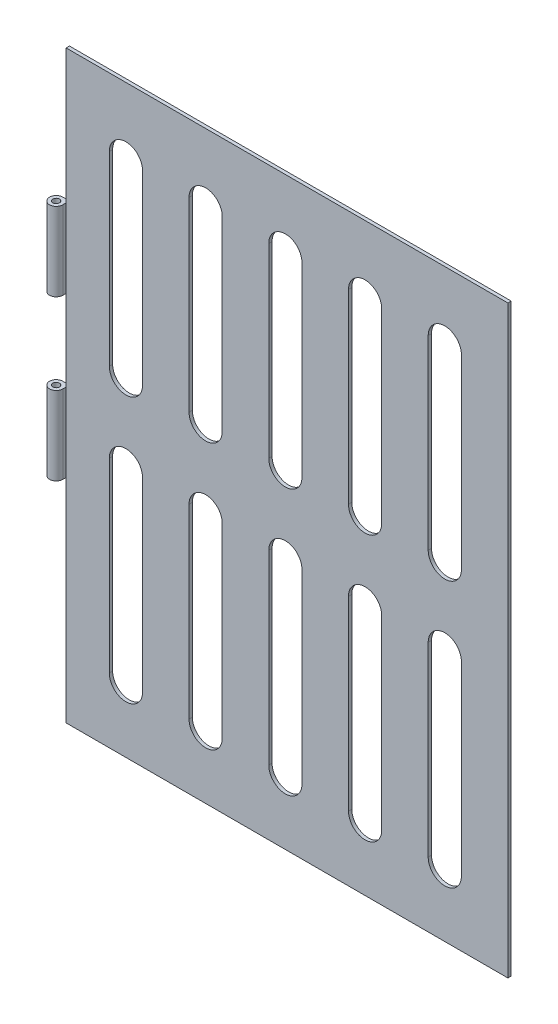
ISO-10303-21;
HEADER;
FILE_DESCRIPTION(('STEP AP214'),'2;1');
FILE_NAME('part.step','',(''),(''),'','','');
FILE_SCHEMA(('AUTOMOTIVE_DESIGN { 1 0 10303 214 1 1 1 1 }'));
ENDSEC;
DATA;
#1=APPLICATION_CONTEXT('core data for automotive mechanical design processes');
#2=APPLICATION_PROTOCOL_DEFINITION('international standard','automotive_design',2000,#1);
#3=PRODUCT_CONTEXT('',#1,'mechanical');
#4=PRODUCT('Part','Part','',(#3));
#5=PRODUCT_RELATED_PRODUCT_CATEGORY('part','',(#4));
#6=PRODUCT_DEFINITION_FORMATION('','',#4);
#7=PRODUCT_DEFINITION_CONTEXT('part definition',#1,'design');
#8=PRODUCT_DEFINITION('design','',#6,#7);
#9=PRODUCT_DEFINITION_SHAPE('','',#8);
#10=(LENGTH_UNIT() NAMED_UNIT(*) SI_UNIT(.MILLI.,.METRE.));
#11=(NAMED_UNIT(*) PLANE_ANGLE_UNIT() SI_UNIT($,.RADIAN.));
#12=(NAMED_UNIT(*) SI_UNIT($,.STERADIAN.) SOLID_ANGLE_UNIT());
#13=UNCERTAINTY_MEASURE_WITH_UNIT(LENGTH_MEASURE(1.E-05),#10,'distance_accuracy_value','');
#14=(GEOMETRIC_REPRESENTATION_CONTEXT(3) GLOBAL_UNCERTAINTY_ASSIGNED_CONTEXT((#13)) GLOBAL_UNIT_ASSIGNED_CONTEXT((#10,
#11,#12)) REPRESENTATION_CONTEXT('',''));
#15=CARTESIAN_POINT('',(0.,0.,0.));
#16=DIRECTION('',(0.,0.,1.));
#17=DIRECTION('',(1.,0.,0.));
#18=AXIS2_PLACEMENT_3D('',#15,#16,#17);
#19=CARTESIAN_POINT('',(0.,0.,-6.35));
#20=DIRECTION('',(-1.,0.,0.));
#21=DIRECTION('',(0.,0.,1.));
#22=AXIS2_PLACEMENT_3D('',#19,#20,#21);
#23=PLANE('',#22);
#24=DIRECTION('',(0.,-1.,0.));
#25=VECTOR('',#24,1.);
#26=CARTESIAN_POINT('',(0.,0.,0.));
#27=LINE('',#26,#25);
#28=CARTESIAN_POINT('',(0.,711.2,0.));
#29=VERTEX_POINT('',#28);
#30=CARTESIAN_POINT('',(0.,556.26,0.));
#31=VERTEX_POINT('',#30);
#32=EDGE_CURVE('E972',#29,#31,#27,.T.);
#33=ORIENTED_EDGE('',*,*,#32,.F.);
#34=DIRECTION('',(0.,0.,-1.));
#35=VECTOR('',#34,1.);
#36=CARTESIAN_POINT('',(0.,711.2,6.35000000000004));
#37=LINE('',#36,#35);
#38=CARTESIAN_POINT('',(0.,711.2,-6.35));
#39=VERTEX_POINT('',#38);
#40=EDGE_CURVE('E918',#29,#39,#37,.T.);
#41=ORIENTED_EDGE('',*,*,#40,.T.);
#42=DIRECTION('',(0.,-1.,0.));
#43=VECTOR('',#42,1.);
#44=CARTESIAN_POINT('',(0.,0.,-6.35));
#45=LINE('',#44,#43);
#46=CARTESIAN_POINT('',(0.,556.26,-6.35));
#47=VERTEX_POINT('',#46);
#48=EDGE_CURVE('E987',#39,#47,#45,.T.);
#49=ORIENTED_EDGE('',*,*,#48,.T.);
#50=DIRECTION('',(0.,0.,-1.));
#51=VECTOR('',#50,1.);
#52=CARTESIAN_POINT('',(0.,556.26,6.35000000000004));
#53=LINE('',#52,#51);
#54=EDGE_CURVE('E952',#31,#47,#53,.T.);
#55=ORIENTED_EDGE('',*,*,#54,.F.);
#56=EDGE_LOOP('',(#33,#41,#49,#55));
#57=FACE_BOUND('',#56,.T.);
#58=ADVANCED_FACE('F375',(#57),#23,.T.);
#59=CARTESIAN_POINT('',(0.,406.4,0.));
#60=VERTEX_POINT('',#59);
#61=CARTESIAN_POINT('',(0.,0.,0.));
#62=VERTEX_POINT('',#61);
#63=EDGE_CURVE('E966',#60,#62,#27,.T.);
#64=ORIENTED_EDGE('',*,*,#63,.F.);
#65=DIRECTION('',(0.,0.,-1.));
#66=VECTOR('',#65,1.);
#67=CARTESIAN_POINT('',(0.,406.4,6.35000000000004));
#68=LINE('',#67,#66);
#69=CARTESIAN_POINT('',(0.,406.4,-6.35));
#70=VERTEX_POINT('',#69);
#71=EDGE_CURVE('E945',#60,#70,#68,.T.);
#72=ORIENTED_EDGE('',*,*,#71,.T.);
#73=CARTESIAN_POINT('',(0.,0.,-6.35));
#74=VERTEX_POINT('',#73);
#75=EDGE_CURVE('E982',#70,#74,#45,.T.);
#76=ORIENTED_EDGE('',*,*,#75,.T.);
#77=DIRECTION('',(0.,0.,1.));
#78=VECTOR('',#77,1.);
#79=CARTESIAN_POINT('',(0.,0.,-6.35));
#80=LINE('',#79,#78);
#81=EDGE_CURVE('E996',#74,#62,#80,.T.);
#82=ORIENTED_EDGE('',*,*,#81,.T.);
#83=EDGE_LOOP('',(#64,#72,#76,#82));
#84=FACE_BOUND('',#83,.T.);
#85=ADVANCED_FACE('F1137',(#84),#23,.T.);
#86=DIRECTION('',(0.,0.,-1.));
#87=VECTOR('',#86,1.);
#88=CARTESIAN_POINT('',(0.,861.06,6.35000000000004));
#89=LINE('',#88,#87);
#90=CARTESIAN_POINT('',(0.,861.06,0.));
#91=VERTEX_POINT('',#90);
#92=CARTESIAN_POINT('',(0.,861.06,-6.35));
#93=VERTEX_POINT('',#92);
#94=EDGE_CURVE('E925',#91,#93,#89,.T.);
#95=ORIENTED_EDGE('',*,*,#94,.F.);
#96=CARTESIAN_POINT('',(0.,1117.6,0.));
#97=VERTEX_POINT('',#96);
#98=EDGE_CURVE('E967',#97,#91,#27,.T.);
#99=ORIENTED_EDGE('',*,*,#98,.F.);
#100=DIRECTION('',(0.,0.,1.));
#101=VECTOR('',#100,1.);
#102=CARTESIAN_POINT('',(0.,1117.6,-6.35));
#103=LINE('',#102,#101);
#104=CARTESIAN_POINT('',(0.,1117.6,-6.35));
#105=VERTEX_POINT('',#104);
#106=EDGE_CURVE('E997',#105,#97,#103,.T.);
#107=ORIENTED_EDGE('',*,*,#106,.F.);
#108=EDGE_CURVE('E983',#105,#93,#45,.T.);
#109=ORIENTED_EDGE('',*,*,#108,.T.);
#110=EDGE_LOOP('',(#95,#99,#107,#109));
#111=FACE_BOUND('',#110,.T.);
#112=ADVANCED_FACE('F377',(#111),#23,.T.);
#113=CARTESIAN_POINT('',(0.,1117.6,-6.35));
#114=DIRECTION('',(0.,1.,0.));
#115=DIRECTION('',(0.,0.,1.));
#116=AXIS2_PLACEMENT_3D('',#113,#114,#115);
#117=PLANE('',#116);
#118=DIRECTION('',(-1.,0.,0.));
#119=VECTOR('',#118,1.);
#120=CARTESIAN_POINT('',(0.,1117.6,0.));
#121=LINE('',#120,#119);
#122=CARTESIAN_POINT('',(844.55,1117.6,0.));
#123=VERTEX_POINT('',#122);
#124=EDGE_CURVE('E979',#123,#97,#121,.T.);
#125=ORIENTED_EDGE('',*,*,#124,.F.);
#126=DIRECTION('',(0.,0.,1.));
#127=VECTOR('',#126,1.);
#128=CARTESIAN_POINT('',(844.55,1117.6,-6.35));
#129=LINE('',#128,#127);
#130=CARTESIAN_POINT('',(844.55,1117.6,-6.35));
#131=VERTEX_POINT('',#130);
#132=EDGE_CURVE('E1000',#131,#123,#129,.T.);
#133=ORIENTED_EDGE('',*,*,#132,.F.);
#134=DIRECTION('',(-1.,0.,0.));
#135=VECTOR('',#134,1.);
#136=CARTESIAN_POINT('',(0.,1117.6,-6.35));
#137=LINE('',#136,#135);
#138=EDGE_CURVE('E993',#131,#105,#137,.T.);
#139=ORIENTED_EDGE('',*,*,#138,.T.);
#140=ORIENTED_EDGE('',*,*,#106,.T.);
#141=EDGE_LOOP('',(#125,#133,#139,#140));
#142=FACE_BOUND('',#141,.T.);
#143=ADVANCED_FACE('F1146',(#142),#117,.T.);
#144=CARTESIAN_POINT('',(844.55,0.,-6.35));
#145=DIRECTION('',(1.,0.,0.));
#146=DIRECTION('',(0.,0.,-1.));
#147=AXIS2_PLACEMENT_3D('',#144,#145,#146);
#148=PLANE('',#147);
#149=DIRECTION('',(0.,1.,0.));
#150=VECTOR('',#149,1.);
#151=CARTESIAN_POINT('',(844.55,0.,0.));
#152=LINE('',#151,#150);
#153=CARTESIAN_POINT('',(844.55,0.,0.));
#154=VERTEX_POINT('',#153);
#155=EDGE_CURVE('E976',#154,#123,#152,.T.);
#156=ORIENTED_EDGE('',*,*,#155,.F.);
#157=DIRECTION('',(0.,0.,1.));
#158=VECTOR('',#157,1.);
#159=CARTESIAN_POINT('',(844.55,0.,-6.35));
#160=LINE('',#159,#158);
#161=CARTESIAN_POINT('',(844.55,0.,-6.35));
#162=VERTEX_POINT('',#161);
#163=EDGE_CURVE('E1002',#162,#154,#160,.T.);
#164=ORIENTED_EDGE('',*,*,#163,.F.);
#165=DIRECTION('',(0.,1.,0.));
#166=VECTOR('',#165,1.);
#167=CARTESIAN_POINT('',(844.55,0.,-6.35));
#168=LINE('',#167,#166);
#169=EDGE_CURVE('E990',#162,#131,#168,.T.);
#170=ORIENTED_EDGE('',*,*,#169,.T.);
#171=ORIENTED_EDGE('',*,*,#132,.T.);
#172=EDGE_LOOP('',(#156,#164,#170,#171));
#173=FACE_BOUND('',#172,.T.);
#174=ADVANCED_FACE('F1152',(#173),#148,.T.);
#175=CARTESIAN_POINT('',(0.,0.,-6.35));
#176=DIRECTION('',(0.,-1.,0.));
#177=DIRECTION('',(0.,0.,-1.));
#178=AXIS2_PLACEMENT_3D('',#175,#176,#177);
#179=PLANE('',#178);
#180=DIRECTION('',(1.,0.,0.));
#181=VECTOR('',#180,1.);
#182=CARTESIAN_POINT('',(0.,0.,0.));
#183=LINE('',#182,#181);
#184=EDGE_CURVE('E970',#62,#154,#183,.T.);
#185=ORIENTED_EDGE('',*,*,#184,.F.);
#186=ORIENTED_EDGE('',*,*,#81,.F.);
#187=DIRECTION('',(1.,0.,0.));
#188=VECTOR('',#187,1.);
#189=CARTESIAN_POINT('',(0.,0.,-6.35));
#190=LINE('',#189,#188);
#191=EDGE_CURVE('E986',#74,#162,#190,.T.);
#192=ORIENTED_EDGE('',*,*,#191,.T.);
#193=ORIENTED_EDGE('',*,*,#163,.T.);
#194=EDGE_LOOP('',(#185,#186,#192,#193));
#195=FACE_BOUND('',#194,.T.);
#196=ADVANCED_FACE('F1204',(#195),#179,.T.);
#197=CARTESIAN_POINT('',(0.,1117.6,-6.35));
#198=DIRECTION('',(0.,0.,-1.));
#199=DIRECTION('',(-1.,0.,0.));
#200=AXIS2_PLACEMENT_3D('',#197,#198,#199);
#201=PLANE('',#200);
#202=CARTESIAN_POINT('',(114.29999999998,479.552000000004,-6.35));
#203=DIRECTION('',(0.,0.,-1.));
#204=DIRECTION('',(1.,0.,0.));
#205=AXIS2_PLACEMENT_3D('',#202,#203,#204);
#206=CIRCLE('',#205,31.7500000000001);
#207=CARTESIAN_POINT('',(82.5499999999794,479.552000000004,-6.35));
#208=VERTEX_POINT('',#207);
#209=CARTESIAN_POINT('',(146.049999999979,479.552000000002,-6.35));
#210=VERTEX_POINT('',#209);
#211=EDGE_CURVE('E390',#208,#210,#206,.T.);
#212=ORIENTED_EDGE('',*,*,#211,.F.);
#213=DIRECTION('',(0.,1.,0.));
#214=VECTOR('',#213,1.);
#215=CARTESIAN_POINT('',(82.5499999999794,479.552000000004,-6.35));
#216=LINE('',#215,#214);
#217=CARTESIAN_POINT('',(82.5499999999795,123.952000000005,-6.35));
#218=VERTEX_POINT('',#217);
#219=EDGE_CURVE('E723',#218,#208,#216,.T.);
#220=ORIENTED_EDGE('',*,*,#219,.F.);
#221=CARTESIAN_POINT('',(114.29999999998,123.952000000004,-6.35));
#222=DIRECTION('',(0.,0.,-1.));
#223=DIRECTION('',(1.,0.,0.));
#224=AXIS2_PLACEMENT_3D('',#221,#222,#223);
#225=CIRCLE('',#224,31.7500000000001);
#226=CARTESIAN_POINT('',(146.049999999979,123.952000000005,-6.35));
#227=VERTEX_POINT('',#226);
#228=EDGE_CURVE('E707',#227,#218,#225,.T.);
#229=ORIENTED_EDGE('',*,*,#228,.F.);
#230=DIRECTION('',(0.,-1.,0.));
#231=VECTOR('',#230,1.);
#232=CARTESIAN_POINT('',(146.049999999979,479.552000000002,-6.35));
#233=LINE('',#232,#231);
#234=EDGE_CURVE('E716',#210,#227,#233,.T.);
#235=ORIENTED_EDGE('',*,*,#234,.F.);
#236=EDGE_LOOP('',(#212,#220,#229,#235));
#237=FACE_BOUND('',#236,.T.);
#238=CARTESIAN_POINT('',(266.699999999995,479.552000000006,-6.35));
#239=DIRECTION('',(0.,0.,-1.));
#240=DIRECTION('',(1.,0.,0.));
#241=AXIS2_PLACEMENT_3D('',#238,#239,#240);
#242=CIRCLE('',#241,31.75);
#243=CARTESIAN_POINT('',(234.949999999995,479.552000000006,-6.35));
#244=VERTEX_POINT('',#243);
#245=CARTESIAN_POINT('',(298.449999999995,479.552000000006,-6.35));
#246=VERTEX_POINT('',#245);
#247=EDGE_CURVE('E730',#244,#246,#242,.T.);
#248=ORIENTED_EDGE('',*,*,#247,.F.);
#249=DIRECTION('',(0.,1.,0.));
#250=VECTOR('',#249,1.);
#251=CARTESIAN_POINT('',(234.949999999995,479.552000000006,-6.35));
#252=LINE('',#251,#250);
#253=CARTESIAN_POINT('',(234.949999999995,123.952000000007,-6.35));
#254=VERTEX_POINT('',#253);
#255=EDGE_CURVE('E740',#254,#244,#252,.T.);
#256=ORIENTED_EDGE('',*,*,#255,.F.);
#257=CARTESIAN_POINT('',(266.699999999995,123.952000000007,-6.35));
#258=DIRECTION('',(0.,0.,-1.));
#259=DIRECTION('',(1.,0.,0.));
#260=AXIS2_PLACEMENT_3D('',#257,#258,#259);
#261=CIRCLE('',#260,31.7499999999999);
#262=CARTESIAN_POINT('',(298.449999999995,123.952000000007,-6.35));
#263=VERTEX_POINT('',#262);
#264=EDGE_CURVE('E737',#263,#254,#261,.T.);
#265=ORIENTED_EDGE('',*,*,#264,.F.);
#266=DIRECTION('',(0.,-1.,0.));
#267=VECTOR('',#266,1.);
#268=CARTESIAN_POINT('',(298.449999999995,479.552000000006,-6.35));
#269=LINE('',#268,#267);
#270=EDGE_CURVE('E734',#246,#263,#269,.T.);
#271=ORIENTED_EDGE('',*,*,#270,.F.);
#272=EDGE_LOOP('',(#248,#256,#265,#271));
#273=FACE_BOUND('',#272,.T.);
#274=CARTESIAN_POINT('',(419.099999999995,479.552000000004,-6.35));
#275=DIRECTION('',(0.,0.,-1.));
#276=DIRECTION('',(1.,0.,0.));
#277=AXIS2_PLACEMENT_3D('',#274,#275,#276);
#278=CIRCLE('',#277,31.75);
#279=CARTESIAN_POINT('',(387.349999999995,479.552000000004,-6.35));
#280=VERTEX_POINT('',#279);
#281=CARTESIAN_POINT('',(450.849999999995,479.552000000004,-6.35));
#282=VERTEX_POINT('',#281);
#283=EDGE_CURVE('E746',#280,#282,#278,.T.);
#284=ORIENTED_EDGE('',*,*,#283,.F.);
#285=DIRECTION('',(0.,1.,0.));
#286=VECTOR('',#285,1.);
#287=CARTESIAN_POINT('',(387.349999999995,479.552000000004,-6.35));
#288=LINE('',#287,#286);
#289=CARTESIAN_POINT('',(387.349999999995,123.952000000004,-6.35));
#290=VERTEX_POINT('',#289);
#291=EDGE_CURVE('E760',#290,#280,#288,.T.);
#292=ORIENTED_EDGE('',*,*,#291,.F.);
#293=CARTESIAN_POINT('',(419.099999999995,123.952000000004,-6.35));
#294=DIRECTION('',(0.,0.,-1.));
#295=DIRECTION('',(1.,0.,0.));
#296=AXIS2_PLACEMENT_3D('',#293,#294,#295);
#297=CIRCLE('',#296,31.7499999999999);
#298=CARTESIAN_POINT('',(450.849999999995,123.952000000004,-6.35));
#299=VERTEX_POINT('',#298);
#300=EDGE_CURVE('E757',#299,#290,#297,.T.);
#301=ORIENTED_EDGE('',*,*,#300,.F.);
#302=DIRECTION('',(0.,-1.,0.));
#303=VECTOR('',#302,1.);
#304=CARTESIAN_POINT('',(450.849999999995,479.552000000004,-6.35));
#305=LINE('',#304,#303);
#306=EDGE_CURVE('E754',#282,#299,#305,.T.);
#307=ORIENTED_EDGE('',*,*,#306,.F.);
#308=EDGE_LOOP('',(#284,#292,#301,#307));
#309=FACE_BOUND('',#308,.T.);
#310=CARTESIAN_POINT('',(571.499999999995,479.552000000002,-6.35));
#311=DIRECTION('',(0.,0.,-1.));
#312=DIRECTION('',(1.,0.,0.));
#313=AXIS2_PLACEMENT_3D('',#310,#311,#312);
#314=CIRCLE('',#313,31.75);
#315=CARTESIAN_POINT('',(539.749999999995,479.552000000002,-6.35));
#316=VERTEX_POINT('',#315);
#317=CARTESIAN_POINT('',(603.249999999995,479.552000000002,-6.35));
#318=VERTEX_POINT('',#317);
#319=EDGE_CURVE('E766',#316,#318,#314,.T.);
#320=ORIENTED_EDGE('',*,*,#319,.F.);
#321=DIRECTION('',(0.,1.,0.));
#322=VECTOR('',#321,1.);
#323=CARTESIAN_POINT('',(539.749999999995,479.552000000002,-6.35));
#324=LINE('',#323,#322);
#325=CARTESIAN_POINT('',(539.749999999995,123.952000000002,-6.35));
#326=VERTEX_POINT('',#325);
#327=EDGE_CURVE('E780',#326,#316,#324,.T.);
#328=ORIENTED_EDGE('',*,*,#327,.F.);
#329=CARTESIAN_POINT('',(571.499999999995,123.952000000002,-6.35));
#330=DIRECTION('',(0.,0.,-1.));
#331=DIRECTION('',(1.,0.,0.));
#332=AXIS2_PLACEMENT_3D('',#329,#330,#331);
#333=CIRCLE('',#332,31.7499999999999);
#334=CARTESIAN_POINT('',(603.249999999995,123.952000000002,-6.35));
#335=VERTEX_POINT('',#334);
#336=EDGE_CURVE('E777',#335,#326,#333,.T.);
#337=ORIENTED_EDGE('',*,*,#336,.F.);
#338=DIRECTION('',(0.,-1.,0.));
#339=VECTOR('',#338,1.);
#340=CARTESIAN_POINT('',(603.249999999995,479.552000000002,-6.35));
#341=LINE('',#340,#339);
#342=EDGE_CURVE('E774',#318,#335,#341,.T.);
#343=ORIENTED_EDGE('',*,*,#342,.F.);
#344=EDGE_LOOP('',(#320,#328,#337,#343));
#345=FACE_BOUND('',#344,.T.);
#346=CARTESIAN_POINT('',(723.899999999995,479.552,-6.35));
#347=DIRECTION('',(0.,0.,-1.));
#348=DIRECTION('',(1.,0.,0.));
#349=AXIS2_PLACEMENT_3D('',#346,#347,#348);
#350=CIRCLE('',#349,31.75);
#351=CARTESIAN_POINT('',(692.149999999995,479.552,-6.35));
#352=VERTEX_POINT('',#351);
#353=CARTESIAN_POINT('',(755.649999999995,479.552,-6.35));
#354=VERTEX_POINT('',#353);
#355=EDGE_CURVE('E786',#352,#354,#350,.T.);
#356=ORIENTED_EDGE('',*,*,#355,.F.);
#357=DIRECTION('',(0.,1.,0.));
#358=VECTOR('',#357,1.);
#359=CARTESIAN_POINT('',(692.149999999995,479.552,-6.35));
#360=LINE('',#359,#358);
#361=CARTESIAN_POINT('',(692.149999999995,123.952,-6.35));
#362=VERTEX_POINT('',#361);
#363=EDGE_CURVE('E800',#362,#352,#360,.T.);
#364=ORIENTED_EDGE('',*,*,#363,.F.);
#365=CARTESIAN_POINT('',(723.899999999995,123.952,-6.35));
#366=DIRECTION('',(0.,0.,-1.));
#367=DIRECTION('',(1.,0.,0.));
#368=AXIS2_PLACEMENT_3D('',#365,#366,#367);
#369=CIRCLE('',#368,31.7499999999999);
#370=CARTESIAN_POINT('',(755.649999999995,123.952,-6.35));
#371=VERTEX_POINT('',#370);
#372=EDGE_CURVE('E797',#371,#362,#369,.T.);
#373=ORIENTED_EDGE('',*,*,#372,.F.);
#374=DIRECTION('',(0.,-1.,0.));
#375=VECTOR('',#374,1.);
#376=CARTESIAN_POINT('',(755.649999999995,479.552,-6.35));
#377=LINE('',#376,#375);
#378=EDGE_CURVE('E794',#354,#371,#377,.T.);
#379=ORIENTED_EDGE('',*,*,#378,.F.);
#380=EDGE_LOOP('',(#356,#364,#373,#379));
#381=FACE_BOUND('',#380,.T.);
#382=CARTESIAN_POINT('',(114.29999999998,987.552000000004,-6.35));
#383=DIRECTION('',(0.,0.,-1.));
#384=DIRECTION('',(1.,0.,0.));
#385=AXIS2_PLACEMENT_3D('',#382,#383,#384);
#386=CIRCLE('',#385,31.7500000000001);
#387=CARTESIAN_POINT('',(82.5499999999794,987.552000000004,-6.35));
#388=VERTEX_POINT('',#387);
#389=CARTESIAN_POINT('',(146.049999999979,987.552000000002,-6.35));
#390=VERTEX_POINT('',#389);
#391=EDGE_CURVE('E806',#388,#390,#386,.T.);
#392=ORIENTED_EDGE('',*,*,#391,.F.);
#393=DIRECTION('',(0.,1.,0.));
#394=VECTOR('',#393,1.);
#395=CARTESIAN_POINT('',(82.5499999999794,987.552000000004,-6.35));
#396=LINE('',#395,#394);
#397=CARTESIAN_POINT('',(82.5499999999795,631.952000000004,-6.35));
#398=VERTEX_POINT('',#397);
#399=EDGE_CURVE('E820',#398,#388,#396,.T.);
#400=ORIENTED_EDGE('',*,*,#399,.F.);
#401=CARTESIAN_POINT('',(114.29999999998,631.952000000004,-6.35));
#402=DIRECTION('',(0.,0.,-1.));
#403=DIRECTION('',(1.,0.,0.));
#404=AXIS2_PLACEMENT_3D('',#401,#402,#403);
#405=CIRCLE('',#404,31.7500000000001);
#406=CARTESIAN_POINT('',(146.049999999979,631.952000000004,-6.35));
#407=VERTEX_POINT('',#406);
#408=EDGE_CURVE('E817',#407,#398,#405,.T.);
#409=ORIENTED_EDGE('',*,*,#408,.F.);
#410=DIRECTION('',(0.,-1.,0.));
#411=VECTOR('',#410,1.);
#412=CARTESIAN_POINT('',(146.049999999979,987.552000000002,-6.35));
#413=LINE('',#412,#411);
#414=EDGE_CURVE('E814',#390,#407,#413,.T.);
#415=ORIENTED_EDGE('',*,*,#414,.F.);
#416=EDGE_LOOP('',(#392,#400,#409,#415));
#417=FACE_BOUND('',#416,.T.);
#418=CARTESIAN_POINT('',(266.699999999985,987.552000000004,-6.35));
#419=DIRECTION('',(0.,0.,-1.));
#420=DIRECTION('',(1.,0.,0.));
#421=AXIS2_PLACEMENT_3D('',#418,#419,#420);
#422=CIRCLE('',#421,31.75);
#423=CARTESIAN_POINT('',(234.949999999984,987.552000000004,-6.35));
#424=VERTEX_POINT('',#423);
#425=CARTESIAN_POINT('',(298.449999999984,987.552000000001,-6.35));
#426=VERTEX_POINT('',#425);
#427=EDGE_CURVE('E826',#424,#426,#422,.T.);
#428=ORIENTED_EDGE('',*,*,#427,.F.);
#429=DIRECTION('',(0.,1.,0.));
#430=VECTOR('',#429,1.);
#431=CARTESIAN_POINT('',(234.949999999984,987.552000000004,-6.35));
#432=LINE('',#431,#430);
#433=CARTESIAN_POINT('',(234.949999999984,631.952000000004,-6.35));
#434=VERTEX_POINT('',#433);
#435=EDGE_CURVE('E840',#434,#424,#432,.T.);
#436=ORIENTED_EDGE('',*,*,#435,.F.);
#437=CARTESIAN_POINT('',(266.699999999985,631.952000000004,-6.35));
#438=DIRECTION('',(0.,0.,-1.));
#439=DIRECTION('',(1.,0.,0.));
#440=AXIS2_PLACEMENT_3D('',#437,#438,#439);
#441=CIRCLE('',#440,31.75);
#442=CARTESIAN_POINT('',(298.449999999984,631.952000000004,-6.35));
#443=VERTEX_POINT('',#442);
#444=EDGE_CURVE('E837',#443,#434,#441,.T.);
#445=ORIENTED_EDGE('',*,*,#444,.F.);
#446=DIRECTION('',(0.,-1.,0.));
#447=VECTOR('',#446,1.);
#448=CARTESIAN_POINT('',(298.449999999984,987.552000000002,-6.35));
#449=LINE('',#448,#447);
#450=EDGE_CURVE('E834',#426,#443,#449,.T.);
#451=ORIENTED_EDGE('',*,*,#450,.F.);
#452=EDGE_LOOP('',(#428,#436,#445,#451));
#453=FACE_BOUND('',#452,.T.);
#454=CARTESIAN_POINT('',(419.1,987.552000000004,-6.35));
#455=DIRECTION('',(0.,0.,-1.));
#456=DIRECTION('',(1.,0.,0.));
#457=AXIS2_PLACEMENT_3D('',#454,#455,#456);
#458=CIRCLE('',#457,31.75);
#459=CARTESIAN_POINT('',(387.35,987.552000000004,-6.35));
#460=VERTEX_POINT('',#459);
#461=CARTESIAN_POINT('',(450.85,987.552000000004,-6.35));
#462=VERTEX_POINT('',#461);
#463=EDGE_CURVE('E846',#460,#462,#458,.T.);
#464=ORIENTED_EDGE('',*,*,#463,.F.);
#465=DIRECTION('',(0.,1.,0.));
#466=VECTOR('',#465,1.);
#467=CARTESIAN_POINT('',(387.35,987.552000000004,-6.35));
#468=LINE('',#467,#466);
#469=CARTESIAN_POINT('',(387.35,631.952000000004,-6.35));
#470=VERTEX_POINT('',#469);
#471=EDGE_CURVE('E860',#470,#460,#468,.T.);
#472=ORIENTED_EDGE('',*,*,#471,.F.);
#473=CARTESIAN_POINT('',(419.1,631.952000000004,-6.35));
#474=DIRECTION('',(0.,0.,-1.));
#475=DIRECTION('',(1.,0.,0.));
#476=AXIS2_PLACEMENT_3D('',#473,#474,#475);
#477=CIRCLE('',#476,31.7499999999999);
#478=CARTESIAN_POINT('',(450.85,631.952000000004,-6.35));
#479=VERTEX_POINT('',#478);
#480=EDGE_CURVE('E857',#479,#470,#477,.T.);
#481=ORIENTED_EDGE('',*,*,#480,.F.);
#482=DIRECTION('',(0.,-1.,0.));
#483=VECTOR('',#482,1.);
#484=CARTESIAN_POINT('',(450.85,987.552000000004,-6.35));
#485=LINE('',#484,#483);
#486=EDGE_CURVE('E854',#462,#479,#485,.T.);
#487=ORIENTED_EDGE('',*,*,#486,.F.);
#488=EDGE_LOOP('',(#464,#472,#481,#487));
#489=FACE_BOUND('',#488,.T.);
#490=CARTESIAN_POINT('',(571.5,987.552000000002,-6.35));
#491=DIRECTION('',(0.,0.,-1.));
#492=DIRECTION('',(1.,0.,0.));
#493=AXIS2_PLACEMENT_3D('',#490,#491,#492);
#494=CIRCLE('',#493,31.75);
#495=CARTESIAN_POINT('',(539.75,987.552000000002,-6.35));
#496=VERTEX_POINT('',#495);
#497=CARTESIAN_POINT('',(603.25,987.552000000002,-6.35));
#498=VERTEX_POINT('',#497);
#499=EDGE_CURVE('E866',#496,#498,#494,.T.);
#500=ORIENTED_EDGE('',*,*,#499,.F.);
#501=DIRECTION('',(0.,1.,0.));
#502=VECTOR('',#501,1.);
#503=CARTESIAN_POINT('',(539.75,987.552000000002,-6.35));
#504=LINE('',#503,#502);
#505=CARTESIAN_POINT('',(539.75,631.952000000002,-6.35));
#506=VERTEX_POINT('',#505);
#507=EDGE_CURVE('E880',#506,#496,#504,.T.);
#508=ORIENTED_EDGE('',*,*,#507,.F.);
#509=CARTESIAN_POINT('',(571.5,631.952000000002,-6.35));
#510=DIRECTION('',(0.,0.,-1.));
#511=DIRECTION('',(1.,0.,0.));
#512=AXIS2_PLACEMENT_3D('',#509,#510,#511);
#513=CIRCLE('',#512,31.7499999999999);
#514=CARTESIAN_POINT('',(603.25,631.952000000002,-6.35));
#515=VERTEX_POINT('',#514);
#516=EDGE_CURVE('E877',#515,#506,#513,.T.);
#517=ORIENTED_EDGE('',*,*,#516,.F.);
#518=DIRECTION('',(0.,-1.,0.));
#519=VECTOR('',#518,1.);
#520=CARTESIAN_POINT('',(603.25,987.552000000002,-6.35));
#521=LINE('',#520,#519);
#522=EDGE_CURVE('E874',#498,#515,#521,.T.);
#523=ORIENTED_EDGE('',*,*,#522,.F.);
#524=EDGE_LOOP('',(#500,#508,#517,#523));
#525=FACE_BOUND('',#524,.T.);
#526=CARTESIAN_POINT('',(723.9,987.552,-6.35));
#527=DIRECTION('',(0.,0.,-1.));
#528=DIRECTION('',(1.,0.,0.));
#529=AXIS2_PLACEMENT_3D('',#526,#527,#528);
#530=CIRCLE('',#529,31.75);
#531=CARTESIAN_POINT('',(692.15,987.552,-6.35));
#532=VERTEX_POINT('',#531);
#533=CARTESIAN_POINT('',(755.65,987.552,-6.35));
#534=VERTEX_POINT('',#533);
#535=EDGE_CURVE('E886',#532,#534,#530,.T.);
#536=ORIENTED_EDGE('',*,*,#535,.F.);
#537=DIRECTION('',(0.,1.,0.));
#538=VECTOR('',#537,1.);
#539=CARTESIAN_POINT('',(692.15,987.552,-6.35));
#540=LINE('',#539,#538);
#541=CARTESIAN_POINT('',(692.15,631.952,-6.35));
#542=VERTEX_POINT('',#541);
#543=EDGE_CURVE('E900',#542,#532,#540,.T.);
#544=ORIENTED_EDGE('',*,*,#543,.F.);
#545=CARTESIAN_POINT('',(723.9,631.952,-6.35));
#546=DIRECTION('',(0.,0.,-1.));
#547=DIRECTION('',(1.,0.,0.));
#548=AXIS2_PLACEMENT_3D('',#545,#546,#547);
#549=CIRCLE('',#548,31.7499999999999);
#550=CARTESIAN_POINT('',(755.65,631.952,-6.35));
#551=VERTEX_POINT('',#550);
#552=EDGE_CURVE('E897',#551,#542,#549,.T.);
#553=ORIENTED_EDGE('',*,*,#552,.F.);
#554=DIRECTION('',(0.,-1.,0.));
#555=VECTOR('',#554,1.);
#556=CARTESIAN_POINT('',(755.65,987.552,-6.35));
#557=LINE('',#556,#555);
#558=EDGE_CURVE('E894',#534,#551,#557,.T.);
#559=ORIENTED_EDGE('',*,*,#558,.F.);
#560=EDGE_LOOP('',(#536,#544,#553,#559));
#561=FACE_BOUND('',#560,.T.);
#562=ORIENTED_EDGE('',*,*,#108,.F.);
#563=ORIENTED_EDGE('',*,*,#138,.F.);
#564=ORIENTED_EDGE('',*,*,#169,.F.);
#565=ORIENTED_EDGE('',*,*,#191,.F.);
#566=ORIENTED_EDGE('',*,*,#75,.F.);
#567=DIRECTION('',(-1.,0.,0.));
#568=VECTOR('',#567,1.);
#569=CARTESIAN_POINT('',(0.,406.4,-6.35));
#570=LINE('',#569,#568);
#571=CARTESIAN_POINT('',(-12.7,406.4,-6.35));
#572=VERTEX_POINT('',#571);
#573=EDGE_CURVE('E948',#70,#572,#570,.T.);
#574=ORIENTED_EDGE('',*,*,#573,.T.);
#575=DIRECTION('',(0.,-1.,0.));
#576=VECTOR('',#575,1.);
#577=CARTESIAN_POINT('',(-12.7,556.26,-6.35));
#578=LINE('',#577,#576);
#579=CARTESIAN_POINT('',(-12.7,556.26,-6.35));
#580=VERTEX_POINT('',#579);
#581=EDGE_CURVE('E963',#580,#572,#578,.T.);
#582=ORIENTED_EDGE('',*,*,#581,.F.);
#583=DIRECTION('',(-1.,0.,0.));
#584=VECTOR('',#583,1.);
#585=CARTESIAN_POINT('',(0.,556.26,-6.35));
#586=LINE('',#585,#584);
#587=EDGE_CURVE('E956',#47,#580,#586,.T.);
#588=ORIENTED_EDGE('',*,*,#587,.F.);
#589=ORIENTED_EDGE('',*,*,#48,.F.);
#590=DIRECTION('',(-1.,0.,0.));
#591=VECTOR('',#590,1.);
#592=CARTESIAN_POINT('',(0.,711.2,-6.35));
#593=LINE('',#592,#591);
#594=CARTESIAN_POINT('',(-12.7,711.2,-6.35));
#595=VERTEX_POINT('',#594);
#596=EDGE_CURVE('E921',#39,#595,#593,.T.);
#597=ORIENTED_EDGE('',*,*,#596,.T.);
#598=DIRECTION('',(0.,-1.,0.));
#599=VECTOR('',#598,1.);
#600=CARTESIAN_POINT('',(-12.7,861.06,-6.35));
#601=LINE('',#600,#599);
#602=CARTESIAN_POINT('',(-12.7,861.06,-6.35));
#603=VERTEX_POINT('',#602);
#604=EDGE_CURVE('E936',#603,#595,#601,.T.);
#605=ORIENTED_EDGE('',*,*,#604,.F.);
#606=DIRECTION('',(-1.,0.,0.));
#607=VECTOR('',#606,1.);
#608=CARTESIAN_POINT('',(0.,861.06,-6.35));
#609=LINE('',#608,#607);
#610=EDGE_CURVE('E929',#93,#603,#609,.T.);
#611=ORIENTED_EDGE('',*,*,#610,.F.);
#612=EDGE_LOOP('',(#562,#563,#564,#565,#566,#574,#582,#588,#589,#597,#605,#611));
#613=FACE_BOUND('',#612,.T.);
#614=ADVANCED_FACE('F720',(#237,#273,#309,#345,#381,#417,#453,#489,#525,#561,#613),#201,.T.);
#615=CARTESIAN_POINT('',(0.,1117.6,0.));
#616=DIRECTION('',(0.,0.,-1.));
#617=DIRECTION('',(-1.,0.,0.));
#618=AXIS2_PLACEMENT_3D('',#615,#616,#617);
#619=PLANE('',#618);
#620=DIRECTION('',(0.,1.,0.));
#621=VECTOR('',#620,1.);
#622=CARTESIAN_POINT('',(82.5499999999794,1117.6,0.));
#623=LINE('',#622,#621);
#624=CARTESIAN_POINT('',(82.5499999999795,123.952000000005,0.));
#625=VERTEX_POINT('',#624);
#626=CARTESIAN_POINT('',(82.5499999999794,479.552000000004,0.));
#627=VERTEX_POINT('',#626);
#628=EDGE_CURVE('E383',#625,#627,#623,.T.);
#629=ORIENTED_EDGE('',*,*,#628,.T.);
#630=CARTESIAN_POINT('',(114.29999999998,479.552000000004,0.));
#631=DIRECTION('',(0.,0.,-1.));
#632=DIRECTION('',(-1.,0.,0.));
#633=AXIS2_PLACEMENT_3D('',#630,#631,#632);
#634=CIRCLE('',#633,31.7500000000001);
#635=CARTESIAN_POINT('',(146.049999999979,479.552000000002,0.));
#636=VERTEX_POINT('',#635);
#637=EDGE_CURVE('E11',#627,#636,#634,.T.);
#638=ORIENTED_EDGE('',*,*,#637,.T.);
#639=DIRECTION('',(0.,-1.,0.));
#640=VECTOR('',#639,1.);
#641=CARTESIAN_POINT('',(146.049999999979,1117.6,0.));
#642=LINE('',#641,#640);
#643=CARTESIAN_POINT('',(146.049999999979,123.952000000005,0.));
#644=VERTEX_POINT('',#643);
#645=EDGE_CURVE('E1113',#636,#644,#642,.T.);
#646=ORIENTED_EDGE('',*,*,#645,.T.);
#647=CARTESIAN_POINT('',(114.29999999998,123.952000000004,0.));
#648=DIRECTION('',(0.,0.,-1.));
#649=DIRECTION('',(-1.,0.,0.));
#650=AXIS2_PLACEMENT_3D('',#647,#648,#649);
#651=CIRCLE('',#650,31.7500000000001);
#652=EDGE_CURVE('E710',#644,#625,#651,.T.);
#653=ORIENTED_EDGE('',*,*,#652,.T.);
#654=EDGE_LOOP('',(#629,#638,#646,#653));
#655=FACE_BOUND('',#654,.T.);
#656=DIRECTION('',(0.,1.,0.));
#657=VECTOR('',#656,1.);
#658=CARTESIAN_POINT('',(234.949999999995,1117.6,0.));
#659=LINE('',#658,#657);
#660=CARTESIAN_POINT('',(234.949999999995,123.952000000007,0.));
#661=VERTEX_POINT('',#660);
#662=CARTESIAN_POINT('',(234.949999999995,479.552000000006,0.));
#663=VERTEX_POINT('',#662);
#664=EDGE_CURVE('E1107',#661,#663,#659,.T.);
#665=ORIENTED_EDGE('',*,*,#664,.T.);
#666=CARTESIAN_POINT('',(266.699999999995,479.552000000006,0.));
#667=DIRECTION('',(0.,0.,-1.));
#668=DIRECTION('',(-1.,0.,0.));
#669=AXIS2_PLACEMENT_3D('',#666,#667,#668);
#670=CIRCLE('',#669,31.75);
#671=CARTESIAN_POINT('',(298.449999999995,479.552000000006,0.));
#672=VERTEX_POINT('',#671);
#673=EDGE_CURVE('E1110',#663,#672,#670,.T.);
#674=ORIENTED_EDGE('',*,*,#673,.T.);
#675=DIRECTION('',(0.,-1.,0.));
#676=VECTOR('',#675,1.);
#677=CARTESIAN_POINT('',(298.449999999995,1117.6,0.));
#678=LINE('',#677,#676);
#679=CARTESIAN_POINT('',(298.449999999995,123.952000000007,0.));
#680=VERTEX_POINT('',#679);
#681=EDGE_CURVE('E1101',#672,#680,#678,.T.);
#682=ORIENTED_EDGE('',*,*,#681,.T.);
#683=CARTESIAN_POINT('',(266.699999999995,123.952000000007,0.));
#684=DIRECTION('',(0.,0.,-1.));
#685=DIRECTION('',(-1.,0.,0.));
#686=AXIS2_PLACEMENT_3D('',#683,#684,#685);
#687=CIRCLE('',#686,31.7499999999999);
#688=EDGE_CURVE('E1104',#680,#661,#687,.T.);
#689=ORIENTED_EDGE('',*,*,#688,.T.);
#690=EDGE_LOOP('',(#665,#674,#682,#689));
#691=FACE_BOUND('',#690,.T.);
#692=DIRECTION('',(0.,1.,0.));
#693=VECTOR('',#692,1.);
#694=CARTESIAN_POINT('',(387.349999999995,1117.6,0.));
#695=LINE('',#694,#693);
#696=CARTESIAN_POINT('',(387.349999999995,123.952000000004,0.));
#697=VERTEX_POINT('',#696);
#698=CARTESIAN_POINT('',(387.349999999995,479.552000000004,0.));
#699=VERTEX_POINT('',#698);
#700=EDGE_CURVE('E1095',#697,#699,#695,.T.);
#701=ORIENTED_EDGE('',*,*,#700,.T.);
#702=CARTESIAN_POINT('',(419.099999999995,479.552000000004,0.));
#703=DIRECTION('',(0.,0.,-1.));
#704=DIRECTION('',(-1.,0.,0.));
#705=AXIS2_PLACEMENT_3D('',#702,#703,#704);
#706=CIRCLE('',#705,31.75);
#707=CARTESIAN_POINT('',(450.849999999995,479.552000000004,0.));
#708=VERTEX_POINT('',#707);
#709=EDGE_CURVE('E1098',#699,#708,#706,.T.);
#710=ORIENTED_EDGE('',*,*,#709,.T.);
#711=DIRECTION('',(0.,-1.,0.));
#712=VECTOR('',#711,1.);
#713=CARTESIAN_POINT('',(450.849999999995,1117.6,0.));
#714=LINE('',#713,#712);
#715=CARTESIAN_POINT('',(450.849999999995,123.952000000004,0.));
#716=VERTEX_POINT('',#715);
#717=EDGE_CURVE('E1089',#708,#716,#714,.T.);
#718=ORIENTED_EDGE('',*,*,#717,.T.);
#719=CARTESIAN_POINT('',(419.099999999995,123.952000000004,0.));
#720=DIRECTION('',(0.,0.,-1.));
#721=DIRECTION('',(-1.,0.,0.));
#722=AXIS2_PLACEMENT_3D('',#719,#720,#721);
#723=CIRCLE('',#722,31.7499999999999);
#724=EDGE_CURVE('E1092',#716,#697,#723,.T.);
#725=ORIENTED_EDGE('',*,*,#724,.T.);
#726=EDGE_LOOP('',(#701,#710,#718,#725));
#727=FACE_BOUND('',#726,.T.);
#728=DIRECTION('',(0.,1.,0.));
#729=VECTOR('',#728,1.);
#730=CARTESIAN_POINT('',(539.749999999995,1117.6,0.));
#731=LINE('',#730,#729);
#732=CARTESIAN_POINT('',(539.749999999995,123.952000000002,0.));
#733=VERTEX_POINT('',#732);
#734=CARTESIAN_POINT('',(539.749999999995,479.552000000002,0.));
#735=VERTEX_POINT('',#734);
#736=EDGE_CURVE('E1083',#733,#735,#731,.T.);
#737=ORIENTED_EDGE('',*,*,#736,.T.);
#738=CARTESIAN_POINT('',(571.499999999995,479.552000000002,0.));
#739=DIRECTION('',(0.,0.,-1.));
#740=DIRECTION('',(-1.,0.,0.));
#741=AXIS2_PLACEMENT_3D('',#738,#739,#740);
#742=CIRCLE('',#741,31.75);
#743=CARTESIAN_POINT('',(603.249999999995,479.552000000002,0.));
#744=VERTEX_POINT('',#743);
#745=EDGE_CURVE('E1086',#735,#744,#742,.T.);
#746=ORIENTED_EDGE('',*,*,#745,.T.);
#747=DIRECTION('',(0.,-1.,0.));
#748=VECTOR('',#747,1.);
#749=CARTESIAN_POINT('',(603.249999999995,1117.6,0.));
#750=LINE('',#749,#748);
#751=CARTESIAN_POINT('',(603.249999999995,123.952000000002,0.));
#752=VERTEX_POINT('',#751);
#753=EDGE_CURVE('E1077',#744,#752,#750,.T.);
#754=ORIENTED_EDGE('',*,*,#753,.T.);
#755=CARTESIAN_POINT('',(571.499999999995,123.952000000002,0.));
#756=DIRECTION('',(0.,0.,-1.));
#757=DIRECTION('',(-1.,0.,0.));
#758=AXIS2_PLACEMENT_3D('',#755,#756,#757);
#759=CIRCLE('',#758,31.7499999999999);
#760=EDGE_CURVE('E1080',#752,#733,#759,.T.);
#761=ORIENTED_EDGE('',*,*,#760,.T.);
#762=EDGE_LOOP('',(#737,#746,#754,#761));
#763=FACE_BOUND('',#762,.T.);
#764=DIRECTION('',(0.,1.,0.));
#765=VECTOR('',#764,1.);
#766=CARTESIAN_POINT('',(692.149999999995,1117.6,0.));
#767=LINE('',#766,#765);
#768=CARTESIAN_POINT('',(692.149999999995,123.952,0.));
#769=VERTEX_POINT('',#768);
#770=CARTESIAN_POINT('',(692.149999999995,479.552,0.));
#771=VERTEX_POINT('',#770);
#772=EDGE_CURVE('E1071',#769,#771,#767,.T.);
#773=ORIENTED_EDGE('',*,*,#772,.T.);
#774=CARTESIAN_POINT('',(723.899999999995,479.552,0.));
#775=DIRECTION('',(0.,0.,-1.));
#776=DIRECTION('',(-1.,0.,0.));
#777=AXIS2_PLACEMENT_3D('',#774,#775,#776);
#778=CIRCLE('',#777,31.75);
#779=CARTESIAN_POINT('',(755.649999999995,479.552,0.));
#780=VERTEX_POINT('',#779);
#781=EDGE_CURVE('E1074',#771,#780,#778,.T.);
#782=ORIENTED_EDGE('',*,*,#781,.T.);
#783=DIRECTION('',(0.,-1.,0.));
#784=VECTOR('',#783,1.);
#785=CARTESIAN_POINT('',(755.649999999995,1117.6,0.));
#786=LINE('',#785,#784);
#787=CARTESIAN_POINT('',(755.649999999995,123.952,0.));
#788=VERTEX_POINT('',#787);
#789=EDGE_CURVE('E1065',#780,#788,#786,.T.);
#790=ORIENTED_EDGE('',*,*,#789,.T.);
#791=CARTESIAN_POINT('',(723.899999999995,123.952,0.));
#792=DIRECTION('',(0.,0.,-1.));
#793=DIRECTION('',(-1.,0.,0.));
#794=AXIS2_PLACEMENT_3D('',#791,#792,#793);
#795=CIRCLE('',#794,31.7499999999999);
#796=EDGE_CURVE('E1068',#788,#769,#795,.T.);
#797=ORIENTED_EDGE('',*,*,#796,.T.);
#798=EDGE_LOOP('',(#773,#782,#790,#797));
#799=FACE_BOUND('',#798,.T.);
#800=DIRECTION('',(0.,1.,0.));
#801=VECTOR('',#800,1.);
#802=CARTESIAN_POINT('',(82.5499999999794,1117.6,0.));
#803=LINE('',#802,#801);
#804=CARTESIAN_POINT('',(82.5499999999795,631.952000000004,0.));
#805=VERTEX_POINT('',#804);
#806=CARTESIAN_POINT('',(82.5499999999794,987.552000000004,0.));
#807=VERTEX_POINT('',#806);
#808=EDGE_CURVE('E1059',#805,#807,#803,.T.);
#809=ORIENTED_EDGE('',*,*,#808,.T.);
#810=CARTESIAN_POINT('',(114.29999999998,987.552000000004,0.));
#811=DIRECTION('',(0.,0.,-1.));
#812=DIRECTION('',(-1.,0.,0.));
#813=AXIS2_PLACEMENT_3D('',#810,#811,#812);
#814=CIRCLE('',#813,31.7500000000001);
#815=CARTESIAN_POINT('',(146.049999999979,987.552000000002,0.));
#816=VERTEX_POINT('',#815);
#817=EDGE_CURVE('E1062',#807,#816,#814,.T.);
#818=ORIENTED_EDGE('',*,*,#817,.T.);
#819=DIRECTION('',(0.,-1.,0.));
#820=VECTOR('',#819,1.);
#821=CARTESIAN_POINT('',(146.049999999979,1117.6,0.));
#822=LINE('',#821,#820);
#823=CARTESIAN_POINT('',(146.049999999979,631.952000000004,0.));
#824=VERTEX_POINT('',#823);
#825=EDGE_CURVE('E1053',#816,#824,#822,.T.);
#826=ORIENTED_EDGE('',*,*,#825,.T.);
#827=CARTESIAN_POINT('',(114.29999999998,631.952000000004,0.));
#828=DIRECTION('',(0.,0.,-1.));
#829=DIRECTION('',(-1.,0.,0.));
#830=AXIS2_PLACEMENT_3D('',#827,#828,#829);
#831=CIRCLE('',#830,31.7500000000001);
#832=EDGE_CURVE('E1056',#824,#805,#831,.T.);
#833=ORIENTED_EDGE('',*,*,#832,.T.);
#834=EDGE_LOOP('',(#809,#818,#826,#833));
#835=FACE_BOUND('',#834,.T.);
#836=DIRECTION('',(0.,1.,0.));
#837=VECTOR('',#836,1.);
#838=CARTESIAN_POINT('',(234.949999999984,1117.6,0.));
#839=LINE('',#838,#837);
#840=CARTESIAN_POINT('',(234.949999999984,631.952000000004,0.));
#841=VERTEX_POINT('',#840);
#842=CARTESIAN_POINT('',(234.949999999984,987.552000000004,0.));
#843=VERTEX_POINT('',#842);
#844=EDGE_CURVE('E1047',#841,#843,#839,.T.);
#845=ORIENTED_EDGE('',*,*,#844,.T.);
#846=CARTESIAN_POINT('',(266.699999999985,987.552000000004,0.));
#847=DIRECTION('',(0.,0.,-1.));
#848=DIRECTION('',(-1.,0.,0.));
#849=AXIS2_PLACEMENT_3D('',#846,#847,#848);
#850=CIRCLE('',#849,31.75);
#851=CARTESIAN_POINT('',(298.449999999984,987.552000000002,0.));
#852=VERTEX_POINT('',#851);
#853=EDGE_CURVE('E1050',#843,#852,#850,.T.);
#854=ORIENTED_EDGE('',*,*,#853,.T.);
#855=DIRECTION('',(0.,-1.,0.));
#856=VECTOR('',#855,1.);
#857=CARTESIAN_POINT('',(298.449999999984,1117.6,0.));
#858=LINE('',#857,#856);
#859=CARTESIAN_POINT('',(298.449999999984,631.952000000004,0.));
#860=VERTEX_POINT('',#859);
#861=EDGE_CURVE('E1041',#852,#860,#858,.T.);
#862=ORIENTED_EDGE('',*,*,#861,.T.);
#863=CARTESIAN_POINT('',(266.699999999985,631.952000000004,0.));
#864=DIRECTION('',(0.,0.,-1.));
#865=DIRECTION('',(-1.,0.,0.));
#866=AXIS2_PLACEMENT_3D('',#863,#864,#865);
#867=CIRCLE('',#866,31.75);
#868=EDGE_CURVE('E1044',#860,#841,#867,.T.);
#869=ORIENTED_EDGE('',*,*,#868,.T.);
#870=EDGE_LOOP('',(#845,#854,#862,#869));
#871=FACE_BOUND('',#870,.T.);
#872=DIRECTION('',(0.,1.,0.));
#873=VECTOR('',#872,1.);
#874=CARTESIAN_POINT('',(387.35,1117.6,0.));
#875=LINE('',#874,#873);
#876=CARTESIAN_POINT('',(387.35,631.952000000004,0.));
#877=VERTEX_POINT('',#876);
#878=CARTESIAN_POINT('',(387.35,987.552000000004,0.));
#879=VERTEX_POINT('',#878);
#880=EDGE_CURVE('E1035',#877,#879,#875,.T.);
#881=ORIENTED_EDGE('',*,*,#880,.T.);
#882=CARTESIAN_POINT('',(419.1,987.552000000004,0.));
#883=DIRECTION('',(0.,0.,-1.));
#884=DIRECTION('',(-1.,0.,0.));
#885=AXIS2_PLACEMENT_3D('',#882,#883,#884);
#886=CIRCLE('',#885,31.75);
#887=CARTESIAN_POINT('',(450.85,987.552000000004,0.));
#888=VERTEX_POINT('',#887);
#889=EDGE_CURVE('E1038',#879,#888,#886,.T.);
#890=ORIENTED_EDGE('',*,*,#889,.T.);
#891=DIRECTION('',(0.,-1.,0.));
#892=VECTOR('',#891,1.);
#893=CARTESIAN_POINT('',(450.85,1117.6,0.));
#894=LINE('',#893,#892);
#895=CARTESIAN_POINT('',(450.85,631.952000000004,0.));
#896=VERTEX_POINT('',#895);
#897=EDGE_CURVE('E1029',#888,#896,#894,.T.);
#898=ORIENTED_EDGE('',*,*,#897,.T.);
#899=CARTESIAN_POINT('',(419.1,631.952000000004,0.));
#900=DIRECTION('',(0.,0.,-1.));
#901=DIRECTION('',(-1.,0.,0.));
#902=AXIS2_PLACEMENT_3D('',#899,#900,#901);
#903=CIRCLE('',#902,31.7499999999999);
#904=EDGE_CURVE('E1032',#896,#877,#903,.T.);
#905=ORIENTED_EDGE('',*,*,#904,.T.);
#906=EDGE_LOOP('',(#881,#890,#898,#905));
#907=FACE_BOUND('',#906,.T.);
#908=DIRECTION('',(0.,1.,0.));
#909=VECTOR('',#908,1.);
#910=CARTESIAN_POINT('',(539.75,1117.6,0.));
#911=LINE('',#910,#909);
#912=CARTESIAN_POINT('',(539.75,631.952000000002,0.));
#913=VERTEX_POINT('',#912);
#914=CARTESIAN_POINT('',(539.75,987.552000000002,0.));
#915=VERTEX_POINT('',#914);
#916=EDGE_CURVE('E1023',#913,#915,#911,.T.);
#917=ORIENTED_EDGE('',*,*,#916,.T.);
#918=CARTESIAN_POINT('',(571.5,987.552000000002,0.));
#919=DIRECTION('',(0.,0.,-1.));
#920=DIRECTION('',(-1.,0.,0.));
#921=AXIS2_PLACEMENT_3D('',#918,#919,#920);
#922=CIRCLE('',#921,31.75);
#923=CARTESIAN_POINT('',(603.25,987.552000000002,0.));
#924=VERTEX_POINT('',#923);
#925=EDGE_CURVE('E1026',#915,#924,#922,.T.);
#926=ORIENTED_EDGE('',*,*,#925,.T.);
#927=DIRECTION('',(0.,-1.,0.));
#928=VECTOR('',#927,1.);
#929=CARTESIAN_POINT('',(603.25,1117.6,0.));
#930=LINE('',#929,#928);
#931=CARTESIAN_POINT('',(603.25,631.952000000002,0.));
#932=VERTEX_POINT('',#931);
#933=EDGE_CURVE('E1017',#924,#932,#930,.T.);
#934=ORIENTED_EDGE('',*,*,#933,.T.);
#935=CARTESIAN_POINT('',(571.5,631.952000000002,0.));
#936=DIRECTION('',(0.,0.,-1.));
#937=DIRECTION('',(-1.,0.,0.));
#938=AXIS2_PLACEMENT_3D('',#935,#936,#937);
#939=CIRCLE('',#938,31.7499999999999);
#940=EDGE_CURVE('E1020',#932,#913,#939,.T.);
#941=ORIENTED_EDGE('',*,*,#940,.T.);
#942=EDGE_LOOP('',(#917,#926,#934,#941));
#943=FACE_BOUND('',#942,.T.);
#944=DIRECTION('',(0.,1.,0.));
#945=VECTOR('',#944,1.);
#946=CARTESIAN_POINT('',(692.15,1117.6,0.));
#947=LINE('',#946,#945);
#948=CARTESIAN_POINT('',(692.15,631.952,0.));
#949=VERTEX_POINT('',#948);
#950=CARTESIAN_POINT('',(692.15,987.552,0.));
#951=VERTEX_POINT('',#950);
#952=EDGE_CURVE('E1011',#949,#951,#947,.T.);
#953=ORIENTED_EDGE('',*,*,#952,.T.);
#954=CARTESIAN_POINT('',(723.9,987.552,0.));
#955=DIRECTION('',(0.,0.,-1.));
#956=DIRECTION('',(-1.,0.,0.));
#957=AXIS2_PLACEMENT_3D('',#954,#955,#956);
#958=CIRCLE('',#957,31.75);
#959=CARTESIAN_POINT('',(755.65,987.552,0.));
#960=VERTEX_POINT('',#959);
#961=EDGE_CURVE('E1014',#951,#960,#958,.T.);
#962=ORIENTED_EDGE('',*,*,#961,.T.);
#963=DIRECTION('',(0.,-1.,0.));
#964=VECTOR('',#963,1.);
#965=CARTESIAN_POINT('',(755.65,1117.6,0.));
#966=LINE('',#965,#964);
#967=CARTESIAN_POINT('',(755.65,631.952,0.));
#968=VERTEX_POINT('',#967);
#969=EDGE_CURVE('E999',#960,#968,#966,.T.);
#970=ORIENTED_EDGE('',*,*,#969,.T.);
#971=CARTESIAN_POINT('',(723.9,631.952,0.));
#972=DIRECTION('',(0.,0.,-1.));
#973=DIRECTION('',(-1.,0.,0.));
#974=AXIS2_PLACEMENT_3D('',#971,#972,#973);
#975=CIRCLE('',#974,31.7499999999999);
#976=EDGE_CURVE('E1008',#968,#949,#975,.T.);
#977=ORIENTED_EDGE('',*,*,#976,.T.);
#978=EDGE_LOOP('',(#953,#962,#970,#977));
#979=FACE_BOUND('',#978,.T.);
#980=ORIENTED_EDGE('',*,*,#98,.T.);
#981=EDGE_CURVE('E971',#91,#29,#27,.T.);
#982=ORIENTED_EDGE('',*,*,#981,.T.);
#983=ORIENTED_EDGE('',*,*,#32,.T.);
#984=EDGE_CURVE('E973',#31,#60,#27,.T.);
#985=ORIENTED_EDGE('',*,*,#984,.T.);
#986=ORIENTED_EDGE('',*,*,#63,.T.);
#987=ORIENTED_EDGE('',*,*,#184,.T.);
#988=ORIENTED_EDGE('',*,*,#155,.T.);
#989=ORIENTED_EDGE('',*,*,#124,.T.);
#990=EDGE_LOOP('',(#980,#982,#983,#985,#986,#987,#988,#989));
#991=FACE_BOUND('',#990,.T.);
#992=ADVANCED_FACE('F1117',(#655,#691,#727,#763,#799,#835,#871,#907,#943,#979,#991),#619,.F.);
#993=CARTESIAN_POINT('',(0.,556.26,6.35000000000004));
#994=DIRECTION('',(-1.,0.,0.));
#995=DIRECTION('',(0.,0.,1.));
#996=AXIS2_PLACEMENT_3D('',#993,#994,#995);
#997=PLANE('',#996);
#998=CARTESIAN_POINT('',(0.,406.4,6.35000000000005));
#999=VERTEX_POINT('',#998);
#1000=EDGE_CURVE('E946',#999,#60,#68,.T.);
#1001=ORIENTED_EDGE('',*,*,#1000,.T.);
#1002=ORIENTED_EDGE('',*,*,#984,.F.);
#1003=CARTESIAN_POINT('',(0.,556.26,6.35000000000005));
#1004=VERTEX_POINT('',#1003);
#1005=EDGE_CURVE('E953',#1004,#31,#53,.T.);
#1006=ORIENTED_EDGE('',*,*,#1005,.F.);
#1007=DIRECTION('',(0.,-1.,0.));
#1008=VECTOR('',#1007,1.);
#1009=CARTESIAN_POINT('',(0.,556.26,6.35000000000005));
#1010=LINE('',#1009,#1008);
#1011=EDGE_CURVE('E960',#1004,#999,#1010,.T.);
#1012=ORIENTED_EDGE('',*,*,#1011,.T.);
#1013=EDGE_LOOP('',(#1001,#1002,#1006,#1012));
#1014=FACE_BOUND('',#1013,.T.);
#1015=ADVANCED_FACE('F1185',(#1014),#997,.F.);
#1016=CARTESIAN_POINT('',(-12.7,556.26,6.35));
#1017=DIRECTION('',(0.,1.,0.));
#1018=DIRECTION('',(0.,0.,1.));
#1019=AXIS2_PLACEMENT_3D('',#1016,#1017,#1018);
#1020=PLANE('',#1019);
#1021=ORIENTED_EDGE('',*,*,#1005,.T.);
#1022=ORIENTED_EDGE('',*,*,#54,.T.);
#1023=ORIENTED_EDGE('',*,*,#587,.T.);
#1024=CARTESIAN_POINT('',(-12.7,556.26,6.35));
#1025=DIRECTION('',(0.,1.,0.));
#1026=DIRECTION('',(0.,0.,1.));
#1027=AXIS2_PLACEMENT_3D('',#1024,#1025,#1026);
#1028=CIRCLE('',#1027,12.7);
#1029=EDGE_CURVE('E958',#580,#1004,#1028,.T.);
#1030=ORIENTED_EDGE('',*,*,#1029,.T.);
#1031=EDGE_LOOP('',(#1021,#1022,#1023,#1030));
#1032=FACE_BOUND('',#1031,.T.);
#1033=CARTESIAN_POINT('',(-12.7,556.26,6.35));
#1034=DIRECTION('',(0.,1.,0.));
#1035=DIRECTION('',(0.,0.,1.));
#1036=AXIS2_PLACEMENT_3D('',#1033,#1034,#1035);
#1037=CIRCLE('',#1036,6.35);
#1038=CARTESIAN_POINT('',(-12.7,556.26,12.7));
#1039=VERTEX_POINT('',#1038);
#1040=EDGE_CURVE('E942',#1039,#1039,#1037,.T.);
#1041=ORIENTED_EDGE('',*,*,#1040,.F.);
#1042=EDGE_LOOP('',(#1041));
#1043=FACE_BOUND('',#1042,.T.);
#1044=ADVANCED_FACE('F1191',(#1032,#1043),#1020,.T.);
#1045=CARTESIAN_POINT('',(-12.7,406.4,6.35));
#1046=DIRECTION('',(0.,1.,0.));
#1047=DIRECTION('',(0.,0.,1.));
#1048=AXIS2_PLACEMENT_3D('',#1045,#1046,#1047);
#1049=PLANE('',#1048);
#1050=ORIENTED_EDGE('',*,*,#1000,.F.);
#1051=CARTESIAN_POINT('',(-12.7,406.4,6.35));
#1052=DIRECTION('',(0.,1.,0.));
#1053=DIRECTION('',(0.,0.,1.));
#1054=AXIS2_PLACEMENT_3D('',#1051,#1052,#1053);
#1055=CIRCLE('',#1054,12.7);
#1056=EDGE_CURVE('E950',#572,#999,#1055,.T.);
#1057=ORIENTED_EDGE('',*,*,#1056,.F.);
#1058=ORIENTED_EDGE('',*,*,#573,.F.);
#1059=ORIENTED_EDGE('',*,*,#71,.F.);
#1060=EDGE_LOOP('',(#1050,#1057,#1058,#1059));
#1061=FACE_BOUND('',#1060,.T.);
#1062=CARTESIAN_POINT('',(-12.7,406.4,6.35));
#1063=DIRECTION('',(0.,1.,0.));
#1064=DIRECTION('',(0.,0.,1.));
#1065=AXIS2_PLACEMENT_3D('',#1062,#1063,#1064);
#1066=CIRCLE('',#1065,6.35);
#1067=CARTESIAN_POINT('',(-12.7,406.4,12.7));
#1068=VERTEX_POINT('',#1067);
#1069=EDGE_CURVE('E939',#1068,#1068,#1066,.T.);
#1070=ORIENTED_EDGE('',*,*,#1069,.T.);
#1071=EDGE_LOOP('',(#1070));
#1072=FACE_BOUND('',#1071,.T.);
#1073=ADVANCED_FACE('F1222',(#1061,#1072),#1049,.F.);
#1074=CARTESIAN_POINT('',(-12.7,556.26,6.35));
#1075=DIRECTION('',(0.,-1.,0.));
#1076=DIRECTION('',(0.,0.,-1.));
#1077=AXIS2_PLACEMENT_3D('',#1074,#1075,#1076);
#1078=CYLINDRICAL_SURFACE('',#1077,12.7);
#1079=ORIENTED_EDGE('',*,*,#1056,.T.);
#1080=ORIENTED_EDGE('',*,*,#1011,.F.);
#1081=ORIENTED_EDGE('',*,*,#1029,.F.);
#1082=ORIENTED_EDGE('',*,*,#581,.T.);
#1083=EDGE_LOOP('',(#1079,#1080,#1081,#1082));
#1084=FACE_BOUND('',#1083,.T.);
#1085=ADVANCED_FACE('F1218',(#1084),#1078,.T.);
#1086=CARTESIAN_POINT('',(-12.7,556.26,6.35));
#1087=DIRECTION('',(0.,-1.,0.));
#1088=DIRECTION('',(0.,0.,-1.));
#1089=AXIS2_PLACEMENT_3D('',#1086,#1087,#1088);
#1090=CYLINDRICAL_SURFACE('',#1089,6.35);
#1091=ORIENTED_EDGE('',*,*,#1040,.T.);
#1092=EDGE_LOOP('',(#1091));
#1093=FACE_BOUND('',#1092,.T.);
#1094=ORIENTED_EDGE('',*,*,#1069,.F.);
#1095=EDGE_LOOP('',(#1094));
#1096=FACE_BOUND('',#1095,.T.);
#1097=ADVANCED_FACE('F1221',(#1093,#1096),#1090,.F.);
#1098=CARTESIAN_POINT('',(0.,861.06,6.35000000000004));
#1099=DIRECTION('',(-1.,0.,0.));
#1100=DIRECTION('',(0.,0.,1.));
#1101=AXIS2_PLACEMENT_3D('',#1098,#1099,#1100);
#1102=PLANE('',#1101);
#1103=CARTESIAN_POINT('',(0.,711.2,6.35000000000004));
#1104=VERTEX_POINT('',#1103);
#1105=EDGE_CURVE('E919',#1104,#29,#37,.T.);
#1106=ORIENTED_EDGE('',*,*,#1105,.T.);
#1107=ORIENTED_EDGE('',*,*,#981,.F.);
#1108=CARTESIAN_POINT('',(0.,861.06,6.35000000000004));
#1109=VERTEX_POINT('',#1108);
#1110=EDGE_CURVE('E926',#1109,#91,#89,.T.);
#1111=ORIENTED_EDGE('',*,*,#1110,.F.);
#1112=DIRECTION('',(0.,-1.,0.));
#1113=VECTOR('',#1112,1.);
#1114=CARTESIAN_POINT('',(0.,861.06,6.35000000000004));
#1115=LINE('',#1114,#1113);
#1116=EDGE_CURVE('E933',#1109,#1104,#1115,.T.);
#1117=ORIENTED_EDGE('',*,*,#1116,.T.);
#1118=EDGE_LOOP('',(#1106,#1107,#1111,#1117));
#1119=FACE_BOUND('',#1118,.T.);
#1120=ADVANCED_FACE('F1178',(#1119),#1102,.F.);
#1121=CARTESIAN_POINT('',(-12.7,861.06,6.35));
#1122=DIRECTION('',(0.,1.,0.));
#1123=DIRECTION('',(0.,0.,1.));
#1124=AXIS2_PLACEMENT_3D('',#1121,#1122,#1123);
#1125=PLANE('',#1124);
#1126=ORIENTED_EDGE('',*,*,#1110,.T.);
#1127=ORIENTED_EDGE('',*,*,#94,.T.);
#1128=ORIENTED_EDGE('',*,*,#610,.T.);
#1129=CARTESIAN_POINT('',(-12.7,861.06,6.35));
#1130=DIRECTION('',(0.,1.,0.));
#1131=DIRECTION('',(0.,0.,1.));
#1132=AXIS2_PLACEMENT_3D('',#1129,#1130,#1131);
#1133=CIRCLE('',#1132,12.7);
#1134=EDGE_CURVE('E931',#603,#1109,#1133,.T.);
#1135=ORIENTED_EDGE('',*,*,#1134,.T.);
#1136=EDGE_LOOP('',(#1126,#1127,#1128,#1135));
#1137=FACE_BOUND('',#1136,.T.);
#1138=CARTESIAN_POINT('',(-12.7,861.06,6.35));
#1139=DIRECTION('',(0.,1.,0.));
#1140=DIRECTION('',(0.,0.,1.));
#1141=AXIS2_PLACEMENT_3D('',#1138,#1139,#1140);
#1142=CIRCLE('',#1141,6.35);
#1143=CARTESIAN_POINT('',(-12.7,861.06,12.7));
#1144=VERTEX_POINT('',#1143);
#1145=EDGE_CURVE('E915',#1144,#1144,#1142,.T.);
#1146=ORIENTED_EDGE('',*,*,#1145,.F.);
#1147=EDGE_LOOP('',(#1146));
#1148=FACE_BOUND('',#1147,.T.);
#1149=ADVANCED_FACE('F1169',(#1137,#1148),#1125,.T.);
#1150=CARTESIAN_POINT('',(-12.7,711.2,6.35));
#1151=DIRECTION('',(0.,1.,0.));
#1152=DIRECTION('',(0.,0.,1.));
#1153=AXIS2_PLACEMENT_3D('',#1150,#1151,#1152);
#1154=PLANE('',#1153);
#1155=ORIENTED_EDGE('',*,*,#1105,.F.);
#1156=CARTESIAN_POINT('',(-12.7,711.2,6.35));
#1157=DIRECTION('',(0.,1.,0.));
#1158=DIRECTION('',(0.,0.,1.));
#1159=AXIS2_PLACEMENT_3D('',#1156,#1157,#1158);
#1160=CIRCLE('',#1159,12.7);
#1161=EDGE_CURVE('E923',#595,#1104,#1160,.T.);
#1162=ORIENTED_EDGE('',*,*,#1161,.F.);
#1163=ORIENTED_EDGE('',*,*,#596,.F.);
#1164=ORIENTED_EDGE('',*,*,#40,.F.);
#1165=EDGE_LOOP('',(#1155,#1162,#1163,#1164));
#1166=FACE_BOUND('',#1165,.T.);
#1167=CARTESIAN_POINT('',(-12.7,711.2,6.35));
#1168=DIRECTION('',(0.,1.,0.));
#1169=DIRECTION('',(0.,0.,1.));
#1170=AXIS2_PLACEMENT_3D('',#1167,#1168,#1169);
#1171=CIRCLE('',#1170,6.35);
#1172=CARTESIAN_POINT('',(-12.7,711.2,12.7));
#1173=VERTEX_POINT('',#1172);
#1174=EDGE_CURVE('E906',#1173,#1173,#1171,.T.);
#1175=ORIENTED_EDGE('',*,*,#1174,.T.);
#1176=EDGE_LOOP('',(#1175));
#1177=FACE_BOUND('',#1176,.T.);
#1178=ADVANCED_FACE('F1235',(#1166,#1177),#1154,.F.);
#1179=CARTESIAN_POINT('',(-12.7,861.06,6.35));
#1180=DIRECTION('',(0.,-1.,0.));
#1181=DIRECTION('',(0.,0.,-1.));
#1182=AXIS2_PLACEMENT_3D('',#1179,#1180,#1181);
#1183=CYLINDRICAL_SURFACE('',#1182,12.7);
#1184=ORIENTED_EDGE('',*,*,#1161,.T.);
#1185=ORIENTED_EDGE('',*,*,#1116,.F.);
#1186=ORIENTED_EDGE('',*,*,#1134,.F.);
#1187=ORIENTED_EDGE('',*,*,#604,.T.);
#1188=EDGE_LOOP('',(#1184,#1185,#1186,#1187));
#1189=FACE_BOUND('',#1188,.T.);
#1190=ADVANCED_FACE('F1174',(#1189),#1183,.T.);
#1191=CARTESIAN_POINT('',(-12.7,861.06,6.35));
#1192=DIRECTION('',(0.,-1.,0.));
#1193=DIRECTION('',(0.,0.,-1.));
#1194=AXIS2_PLACEMENT_3D('',#1191,#1192,#1193);
#1195=CYLINDRICAL_SURFACE('',#1194,6.35);
#1196=ORIENTED_EDGE('',*,*,#1145,.T.);
#1197=EDGE_LOOP('',(#1196));
#1198=FACE_BOUND('',#1197,.T.);
#1199=ORIENTED_EDGE('',*,*,#1174,.F.);
#1200=EDGE_LOOP('',(#1199));
#1201=FACE_BOUND('',#1200,.T.);
#1202=ADVANCED_FACE('F1234',(#1198,#1201),#1195,.F.);
#1203=CARTESIAN_POINT('',(723.9,987.552,19.05));
#1204=DIRECTION('',(0.,0.,-1.));
#1205=DIRECTION('',(-1.,0.,0.));
#1206=AXIS2_PLACEMENT_3D('',#1203,#1204,#1205);
#1207=CYLINDRICAL_SURFACE('',#1206,31.75);
#1208=DIRECTION('',(0.,0.,-1.));
#1209=VECTOR('',#1208,1.);
#1210=CARTESIAN_POINT('',(692.15,987.552,19.05));
#1211=LINE('',#1210,#1209);
#1212=EDGE_CURVE('E904',#951,#532,#1211,.T.);
#1213=ORIENTED_EDGE('',*,*,#1212,.T.);
#1214=ORIENTED_EDGE('',*,*,#535,.T.);
#1215=DIRECTION('',(0.,0.,-1.));
#1216=VECTOR('',#1215,1.);
#1217=CARTESIAN_POINT('',(755.65,987.552,19.05));
#1218=LINE('',#1217,#1216);
#1219=EDGE_CURVE('E903',#960,#534,#1218,.T.);
#1220=ORIENTED_EDGE('',*,*,#1219,.F.);
#1221=ORIENTED_EDGE('',*,*,#961,.F.);
#1222=EDGE_LOOP('',(#1213,#1214,#1220,#1221));
#1223=FACE_BOUND('',#1222,.T.);
#1224=ADVANCED_FACE('F1243',(#1223),#1207,.F.);
#1225=CARTESIAN_POINT('',(692.15,987.552,19.05));
#1226=DIRECTION('',(-1.,0.,0.));
#1227=DIRECTION('',(0.,0.,1.));
#1228=AXIS2_PLACEMENT_3D('',#1225,#1226,#1227);
#1229=PLANE('',#1228);
#1230=DIRECTION('',(0.,0.,-1.));
#1231=VECTOR('',#1230,1.);
#1232=CARTESIAN_POINT('',(692.15,631.952,19.05));
#1233=LINE('',#1232,#1231);
#1234=EDGE_CURVE('E907',#949,#542,#1233,.T.);
#1235=ORIENTED_EDGE('',*,*,#1234,.T.);
#1236=ORIENTED_EDGE('',*,*,#543,.T.);
#1237=ORIENTED_EDGE('',*,*,#1212,.F.);
#1238=ORIENTED_EDGE('',*,*,#952,.F.);
#1239=EDGE_LOOP('',(#1235,#1236,#1237,#1238));
#1240=FACE_BOUND('',#1239,.T.);
#1241=ADVANCED_FACE('F1247',(#1240),#1229,.F.);
#1242=CARTESIAN_POINT('',(723.9,631.952,19.05));
#1243=DIRECTION('',(0.,0.,-1.));
#1244=DIRECTION('',(-1.,0.,0.));
#1245=AXIS2_PLACEMENT_3D('',#1242,#1243,#1244);
#1246=CYLINDRICAL_SURFACE('',#1245,31.7499999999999);
#1247=DIRECTION('',(0.,0.,-1.));
#1248=VECTOR('',#1247,1.);
#1249=CARTESIAN_POINT('',(755.65,631.952,19.05));
#1250=LINE('',#1249,#1248);
#1251=EDGE_CURVE('E909',#968,#551,#1250,.T.);
#1252=ORIENTED_EDGE('',*,*,#1251,.T.);
#1253=ORIENTED_EDGE('',*,*,#552,.T.);
#1254=ORIENTED_EDGE('',*,*,#1234,.F.);
#1255=ORIENTED_EDGE('',*,*,#976,.F.);
#1256=EDGE_LOOP('',(#1252,#1253,#1254,#1255));
#1257=FACE_BOUND('',#1256,.T.);
#1258=ADVANCED_FACE('F1253',(#1257),#1246,.F.);
#1259=CARTESIAN_POINT('',(755.65,987.552,19.05));
#1260=DIRECTION('',(1.,0.,0.));
#1261=DIRECTION('',(0.,1.,0.));
#1262=AXIS2_PLACEMENT_3D('',#1259,#1260,#1261);
#1263=PLANE('',#1262);
#1264=ORIENTED_EDGE('',*,*,#1219,.T.);
#1265=ORIENTED_EDGE('',*,*,#558,.T.);
#1266=ORIENTED_EDGE('',*,*,#1251,.F.);
#1267=ORIENTED_EDGE('',*,*,#969,.F.);
#1268=EDGE_LOOP('',(#1264,#1265,#1266,#1267));
#1269=FACE_BOUND('',#1268,.T.);
#1270=ADVANCED_FACE('F1249',(#1269),#1263,.F.);
#1271=CARTESIAN_POINT('',(571.5,987.552000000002,19.05));
#1272=DIRECTION('',(0.,0.,-1.));
#1273=DIRECTION('',(-1.,0.,0.));
#1274=AXIS2_PLACEMENT_3D('',#1271,#1272,#1273);
#1275=CYLINDRICAL_SURFACE('',#1274,31.75);
#1276=DIRECTION('',(0.,0.,-1.));
#1277=VECTOR('',#1276,1.);
#1278=CARTESIAN_POINT('',(539.75,987.552000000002,19.05));
#1279=LINE('',#1278,#1277);
#1280=EDGE_CURVE('E884',#915,#496,#1279,.T.);
#1281=ORIENTED_EDGE('',*,*,#1280,.T.);
#1282=ORIENTED_EDGE('',*,*,#499,.T.);
#1283=DIRECTION('',(0.,0.,-1.));
#1284=VECTOR('',#1283,1.);
#1285=CARTESIAN_POINT('',(603.25,987.552000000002,19.05));
#1286=LINE('',#1285,#1284);
#1287=EDGE_CURVE('E883',#924,#498,#1286,.T.);
#1288=ORIENTED_EDGE('',*,*,#1287,.F.);
#1289=ORIENTED_EDGE('',*,*,#925,.F.);
#1290=EDGE_LOOP('',(#1281,#1282,#1288,#1289));
#1291=FACE_BOUND('',#1290,.T.);
#1292=ADVANCED_FACE('F1252',(#1291),#1275,.F.);
#1293=CARTESIAN_POINT('',(539.75,987.552000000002,19.05));
#1294=DIRECTION('',(-1.,0.,0.));
#1295=DIRECTION('',(0.,0.,1.));
#1296=AXIS2_PLACEMENT_3D('',#1293,#1294,#1295);
#1297=PLANE('',#1296);
#1298=DIRECTION('',(0.,0.,-1.));
#1299=VECTOR('',#1298,1.);
#1300=CARTESIAN_POINT('',(539.75,631.952000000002,19.05));
#1301=LINE('',#1300,#1299);
#1302=EDGE_CURVE('E887',#913,#506,#1301,.T.);
#1303=ORIENTED_EDGE('',*,*,#1302,.T.);
#1304=ORIENTED_EDGE('',*,*,#507,.T.);
#1305=ORIENTED_EDGE('',*,*,#1280,.F.);
#1306=ORIENTED_EDGE('',*,*,#916,.F.);
#1307=EDGE_LOOP('',(#1303,#1304,#1305,#1306));
#1308=FACE_BOUND('',#1307,.T.);
#1309=ADVANCED_FACE('F1263',(#1308),#1297,.F.);
#1310=CARTESIAN_POINT('',(571.5,631.952000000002,19.05));
#1311=DIRECTION('',(0.,0.,-1.));
#1312=DIRECTION('',(-1.,0.,0.));
#1313=AXIS2_PLACEMENT_3D('',#1310,#1311,#1312);
#1314=CYLINDRICAL_SURFACE('',#1313,31.7499999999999);
#1315=DIRECTION('',(0.,0.,-1.));
#1316=VECTOR('',#1315,1.);
#1317=CARTESIAN_POINT('',(603.25,631.952000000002,19.05));
#1318=LINE('',#1317,#1316);
#1319=EDGE_CURVE('E889',#932,#515,#1318,.T.);
#1320=ORIENTED_EDGE('',*,*,#1319,.T.);
#1321=ORIENTED_EDGE('',*,*,#516,.T.);
#1322=ORIENTED_EDGE('',*,*,#1302,.F.);
#1323=ORIENTED_EDGE('',*,*,#940,.F.);
#1324=EDGE_LOOP('',(#1320,#1321,#1322,#1323));
#1325=FACE_BOUND('',#1324,.T.);
#1326=ADVANCED_FACE('F1269',(#1325),#1314,.F.);
#1327=CARTESIAN_POINT('',(603.25,987.552000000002,19.05));
#1328=DIRECTION('',(1.,0.,0.));
#1329=DIRECTION('',(0.,1.,0.));
#1330=AXIS2_PLACEMENT_3D('',#1327,#1328,#1329);
#1331=PLANE('',#1330);
#1332=ORIENTED_EDGE('',*,*,#1287,.T.);
#1333=ORIENTED_EDGE('',*,*,#522,.T.);
#1334=ORIENTED_EDGE('',*,*,#1319,.F.);
#1335=ORIENTED_EDGE('',*,*,#933,.F.);
#1336=EDGE_LOOP('',(#1332,#1333,#1334,#1335));
#1337=FACE_BOUND('',#1336,.T.);
#1338=ADVANCED_FACE('F1265',(#1337),#1331,.F.);
#1339=CARTESIAN_POINT('',(419.1,987.552000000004,19.05));
#1340=DIRECTION('',(0.,0.,-1.));
#1341=DIRECTION('',(-1.,0.,0.));
#1342=AXIS2_PLACEMENT_3D('',#1339,#1340,#1341);
#1343=CYLINDRICAL_SURFACE('',#1342,31.75);
#1344=DIRECTION('',(0.,0.,-1.));
#1345=VECTOR('',#1344,1.);
#1346=CARTESIAN_POINT('',(387.35,987.552000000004,19.05));
#1347=LINE('',#1346,#1345);
#1348=EDGE_CURVE('E864',#879,#460,#1347,.T.);
#1349=ORIENTED_EDGE('',*,*,#1348,.T.);
#1350=ORIENTED_EDGE('',*,*,#463,.T.);
#1351=DIRECTION('',(0.,0.,-1.));
#1352=VECTOR('',#1351,1.);
#1353=CARTESIAN_POINT('',(450.85,987.552000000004,19.05));
#1354=LINE('',#1353,#1352);
#1355=EDGE_CURVE('E863',#888,#462,#1354,.T.);
#1356=ORIENTED_EDGE('',*,*,#1355,.F.);
#1357=ORIENTED_EDGE('',*,*,#889,.F.);
#1358=EDGE_LOOP('',(#1349,#1350,#1356,#1357));
#1359=FACE_BOUND('',#1358,.T.);
#1360=ADVANCED_FACE('F1268',(#1359),#1343,.F.);
#1361=CARTESIAN_POINT('',(387.35,987.552000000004,19.05));
#1362=DIRECTION('',(-1.,0.,0.));
#1363=DIRECTION('',(0.,0.,1.));
#1364=AXIS2_PLACEMENT_3D('',#1361,#1362,#1363);
#1365=PLANE('',#1364);
#1366=DIRECTION('',(0.,0.,-1.));
#1367=VECTOR('',#1366,1.);
#1368=CARTESIAN_POINT('',(387.35,631.952000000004,19.05));
#1369=LINE('',#1368,#1367);
#1370=EDGE_CURVE('E867',#877,#470,#1369,.T.);
#1371=ORIENTED_EDGE('',*,*,#1370,.T.);
#1372=ORIENTED_EDGE('',*,*,#471,.T.);
#1373=ORIENTED_EDGE('',*,*,#1348,.F.);
#1374=ORIENTED_EDGE('',*,*,#880,.F.);
#1375=EDGE_LOOP('',(#1371,#1372,#1373,#1374));
#1376=FACE_BOUND('',#1375,.T.);
#1377=ADVANCED_FACE('F1279',(#1376),#1365,.F.);
#1378=CARTESIAN_POINT('',(419.1,631.952000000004,19.05));
#1379=DIRECTION('',(0.,0.,-1.));
#1380=DIRECTION('',(-1.,0.,0.));
#1381=AXIS2_PLACEMENT_3D('',#1378,#1379,#1380);
#1382=CYLINDRICAL_SURFACE('',#1381,31.7499999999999);
#1383=DIRECTION('',(0.,0.,-1.));
#1384=VECTOR('',#1383,1.);
#1385=CARTESIAN_POINT('',(450.85,631.952000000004,19.05));
#1386=LINE('',#1385,#1384);
#1387=EDGE_CURVE('E869',#896,#479,#1386,.T.);
#1388=ORIENTED_EDGE('',*,*,#1387,.T.);
#1389=ORIENTED_EDGE('',*,*,#480,.T.);
#1390=ORIENTED_EDGE('',*,*,#1370,.F.);
#1391=ORIENTED_EDGE('',*,*,#904,.F.);
#1392=EDGE_LOOP('',(#1388,#1389,#1390,#1391));
#1393=FACE_BOUND('',#1392,.T.);
#1394=ADVANCED_FACE('F1285',(#1393),#1382,.F.);
#1395=CARTESIAN_POINT('',(450.85,987.552000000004,19.05));
#1396=DIRECTION('',(1.,0.,0.));
#1397=DIRECTION('',(0.,1.,0.));
#1398=AXIS2_PLACEMENT_3D('',#1395,#1396,#1397);
#1399=PLANE('',#1398);
#1400=ORIENTED_EDGE('',*,*,#1355,.T.);
#1401=ORIENTED_EDGE('',*,*,#486,.T.);
#1402=ORIENTED_EDGE('',*,*,#1387,.F.);
#1403=ORIENTED_EDGE('',*,*,#897,.F.);
#1404=EDGE_LOOP('',(#1400,#1401,#1402,#1403));
#1405=FACE_BOUND('',#1404,.T.);
#1406=ADVANCED_FACE('F1281',(#1405),#1399,.F.);
#1407=CARTESIAN_POINT('',(266.699999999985,987.552000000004,19.05));
#1408=DIRECTION('',(0.,0.,-1.));
#1409=DIRECTION('',(-1.,0.,0.));
#1410=AXIS2_PLACEMENT_3D('',#1407,#1408,#1409);
#1411=CYLINDRICAL_SURFACE('',#1410,31.75);
#1412=DIRECTION('',(0.,0.,-1.));
#1413=VECTOR('',#1412,1.);
#1414=CARTESIAN_POINT('',(234.949999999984,987.552000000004,19.05));
#1415=LINE('',#1414,#1413);
#1416=EDGE_CURVE('E844',#843,#424,#1415,.T.);
#1417=ORIENTED_EDGE('',*,*,#1416,.T.);
#1418=ORIENTED_EDGE('',*,*,#427,.T.);
#1419=DIRECTION('',(0.,0.,-1.));
#1420=VECTOR('',#1419,1.);
#1421=CARTESIAN_POINT('',(298.449999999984,987.552000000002,19.05));
#1422=LINE('',#1421,#1420);
#1423=EDGE_CURVE('E843',#852,#426,#1422,.T.);
#1424=ORIENTED_EDGE('',*,*,#1423,.F.);
#1425=ORIENTED_EDGE('',*,*,#853,.F.);
#1426=EDGE_LOOP('',(#1417,#1418,#1424,#1425));
#1427=FACE_BOUND('',#1426,.T.);
#1428=ADVANCED_FACE('F1284',(#1427),#1411,.F.);
#1429=CARTESIAN_POINT('',(234.949999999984,987.552000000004,19.05));
#1430=DIRECTION('',(-1.,0.,0.));
#1431=DIRECTION('',(0.,0.,1.));
#1432=AXIS2_PLACEMENT_3D('',#1429,#1430,#1431);
#1433=PLANE('',#1432);
#1434=DIRECTION('',(0.,0.,-1.));
#1435=VECTOR('',#1434,1.);
#1436=CARTESIAN_POINT('',(234.949999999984,631.952000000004,19.05));
#1437=LINE('',#1436,#1435);
#1438=EDGE_CURVE('E847',#841,#434,#1437,.T.);
#1439=ORIENTED_EDGE('',*,*,#1438,.T.);
#1440=ORIENTED_EDGE('',*,*,#435,.T.);
#1441=ORIENTED_EDGE('',*,*,#1416,.F.);
#1442=ORIENTED_EDGE('',*,*,#844,.F.);
#1443=EDGE_LOOP('',(#1439,#1440,#1441,#1442));
#1444=FACE_BOUND('',#1443,.T.);
#1445=ADVANCED_FACE('F1295',(#1444),#1433,.F.);
#1446=CARTESIAN_POINT('',(266.699999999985,631.952000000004,19.05));
#1447=DIRECTION('',(0.,0.,-1.));
#1448=DIRECTION('',(-1.,0.,0.));
#1449=AXIS2_PLACEMENT_3D('',#1446,#1447,#1448);
#1450=CYLINDRICAL_SURFACE('',#1449,31.75);
#1451=DIRECTION('',(0.,0.,-1.));
#1452=VECTOR('',#1451,1.);
#1453=CARTESIAN_POINT('',(298.449999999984,631.952000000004,19.05));
#1454=LINE('',#1453,#1452);
#1455=EDGE_CURVE('E849',#860,#443,#1454,.T.);
#1456=ORIENTED_EDGE('',*,*,#1455,.T.);
#1457=ORIENTED_EDGE('',*,*,#444,.T.);
#1458=ORIENTED_EDGE('',*,*,#1438,.F.);
#1459=ORIENTED_EDGE('',*,*,#868,.F.);
#1460=EDGE_LOOP('',(#1456,#1457,#1458,#1459));
#1461=FACE_BOUND('',#1460,.T.);
#1462=ADVANCED_FACE('F1301',(#1461),#1450,.F.);
#1463=CARTESIAN_POINT('',(298.449999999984,987.552000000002,19.05));
#1464=DIRECTION('',(1.,0.,0.));
#1465=DIRECTION('',(0.,0.,-1.));
#1466=AXIS2_PLACEMENT_3D('',#1463,#1464,#1465);
#1467=PLANE('',#1466);
#1468=ORIENTED_EDGE('',*,*,#1423,.T.);
#1469=ORIENTED_EDGE('',*,*,#450,.T.);
#1470=ORIENTED_EDGE('',*,*,#1455,.F.);
#1471=ORIENTED_EDGE('',*,*,#861,.F.);
#1472=EDGE_LOOP('',(#1468,#1469,#1470,#1471));
#1473=FACE_BOUND('',#1472,.T.);
#1474=ADVANCED_FACE('F1297',(#1473),#1467,.F.);
#1475=CARTESIAN_POINT('',(114.29999999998,987.552000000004,19.05));
#1476=DIRECTION('',(0.,0.,-1.));
#1477=DIRECTION('',(-1.,0.,0.));
#1478=AXIS2_PLACEMENT_3D('',#1475,#1476,#1477);
#1479=CYLINDRICAL_SURFACE('',#1478,31.7500000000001);
#1480=DIRECTION('',(0.,0.,-1.));
#1481=VECTOR('',#1480,1.);
#1482=CARTESIAN_POINT('',(82.5499999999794,987.552000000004,19.05));
#1483=LINE('',#1482,#1481);
#1484=EDGE_CURVE('E824',#807,#388,#1483,.T.);
#1485=ORIENTED_EDGE('',*,*,#1484,.T.);
#1486=ORIENTED_EDGE('',*,*,#391,.T.);
#1487=DIRECTION('',(0.,0.,-1.));
#1488=VECTOR('',#1487,1.);
#1489=CARTESIAN_POINT('',(146.049999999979,987.552000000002,19.05));
#1490=LINE('',#1489,#1488);
#1491=EDGE_CURVE('E823',#816,#390,#1490,.T.);
#1492=ORIENTED_EDGE('',*,*,#1491,.F.);
#1493=ORIENTED_EDGE('',*,*,#817,.F.);
#1494=EDGE_LOOP('',(#1485,#1486,#1492,#1493));
#1495=FACE_BOUND('',#1494,.T.);
#1496=ADVANCED_FACE('F1300',(#1495),#1479,.F.);
#1497=CARTESIAN_POINT('',(82.5499999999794,987.552000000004,19.05));
#1498=DIRECTION('',(-1.,0.,0.));
#1499=DIRECTION('',(0.,0.,1.));
#1500=AXIS2_PLACEMENT_3D('',#1497,#1498,#1499);
#1501=PLANE('',#1500);
#1502=DIRECTION('',(0.,0.,-1.));
#1503=VECTOR('',#1502,1.);
#1504=CARTESIAN_POINT('',(82.5499999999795,631.952000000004,19.05));
#1505=LINE('',#1504,#1503);
#1506=EDGE_CURVE('E827',#805,#398,#1505,.T.);
#1507=ORIENTED_EDGE('',*,*,#1506,.T.);
#1508=ORIENTED_EDGE('',*,*,#399,.T.);
#1509=ORIENTED_EDGE('',*,*,#1484,.F.);
#1510=ORIENTED_EDGE('',*,*,#808,.F.);
#1511=EDGE_LOOP('',(#1507,#1508,#1509,#1510));
#1512=FACE_BOUND('',#1511,.T.);
#1513=ADVANCED_FACE('F1311',(#1512),#1501,.F.);
#1514=CARTESIAN_POINT('',(114.29999999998,631.952000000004,19.05));
#1515=DIRECTION('',(0.,0.,-1.));
#1516=DIRECTION('',(-1.,0.,0.));
#1517=AXIS2_PLACEMENT_3D('',#1514,#1515,#1516);
#1518=CYLINDRICAL_SURFACE('',#1517,31.7500000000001);
#1519=DIRECTION('',(0.,0.,-1.));
#1520=VECTOR('',#1519,1.);
#1521=CARTESIAN_POINT('',(146.049999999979,631.952000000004,19.05));
#1522=LINE('',#1521,#1520);
#1523=EDGE_CURVE('E829',#824,#407,#1522,.T.);
#1524=ORIENTED_EDGE('',*,*,#1523,.T.);
#1525=ORIENTED_EDGE('',*,*,#408,.T.);
#1526=ORIENTED_EDGE('',*,*,#1506,.F.);
#1527=ORIENTED_EDGE('',*,*,#832,.F.);
#1528=EDGE_LOOP('',(#1524,#1525,#1526,#1527));
#1529=FACE_BOUND('',#1528,.T.);
#1530=ADVANCED_FACE('F1317',(#1529),#1518,.F.);
#1531=CARTESIAN_POINT('',(146.049999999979,987.552000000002,19.05));
#1532=DIRECTION('',(1.,0.,0.));
#1533=DIRECTION('',(0.,0.,-1.));
#1534=AXIS2_PLACEMENT_3D('',#1531,#1532,#1533);
#1535=PLANE('',#1534);
#1536=ORIENTED_EDGE('',*,*,#1491,.T.);
#1537=ORIENTED_EDGE('',*,*,#414,.T.);
#1538=ORIENTED_EDGE('',*,*,#1523,.F.);
#1539=ORIENTED_EDGE('',*,*,#825,.F.);
#1540=EDGE_LOOP('',(#1536,#1537,#1538,#1539));
#1541=FACE_BOUND('',#1540,.T.);
#1542=ADVANCED_FACE('F1313',(#1541),#1535,.F.);
#1543=CARTESIAN_POINT('',(723.899999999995,479.552,19.05));
#1544=DIRECTION('',(0.,0.,-1.));
#1545=DIRECTION('',(-1.,0.,0.));
#1546=AXIS2_PLACEMENT_3D('',#1543,#1544,#1545);
#1547=CYLINDRICAL_SURFACE('',#1546,31.75);
#1548=DIRECTION('',(0.,0.,-1.));
#1549=VECTOR('',#1548,1.);
#1550=CARTESIAN_POINT('',(692.149999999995,479.552,19.05));
#1551=LINE('',#1550,#1549);
#1552=EDGE_CURVE('E804',#771,#352,#1551,.T.);
#1553=ORIENTED_EDGE('',*,*,#1552,.T.);
#1554=ORIENTED_EDGE('',*,*,#355,.T.);
#1555=DIRECTION('',(0.,0.,-1.));
#1556=VECTOR('',#1555,1.);
#1557=CARTESIAN_POINT('',(755.649999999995,479.552,19.05));
#1558=LINE('',#1557,#1556);
#1559=EDGE_CURVE('E803',#780,#354,#1558,.T.);
#1560=ORIENTED_EDGE('',*,*,#1559,.F.);
#1561=ORIENTED_EDGE('',*,*,#781,.F.);
#1562=EDGE_LOOP('',(#1553,#1554,#1560,#1561));
#1563=FACE_BOUND('',#1562,.T.);
#1564=ADVANCED_FACE('F1316',(#1563),#1547,.F.);
#1565=CARTESIAN_POINT('',(692.149999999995,479.552,19.05));
#1566=DIRECTION('',(-1.,0.,0.));
#1567=DIRECTION('',(0.,0.,1.));
#1568=AXIS2_PLACEMENT_3D('',#1565,#1566,#1567);
#1569=PLANE('',#1568);
#1570=DIRECTION('',(0.,0.,-1.));
#1571=VECTOR('',#1570,1.);
#1572=CARTESIAN_POINT('',(692.149999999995,123.952,19.05));
#1573=LINE('',#1572,#1571);
#1574=EDGE_CURVE('E807',#769,#362,#1573,.T.);
#1575=ORIENTED_EDGE('',*,*,#1574,.T.);
#1576=ORIENTED_EDGE('',*,*,#363,.T.);
#1577=ORIENTED_EDGE('',*,*,#1552,.F.);
#1578=ORIENTED_EDGE('',*,*,#772,.F.);
#1579=EDGE_LOOP('',(#1575,#1576,#1577,#1578));
#1580=FACE_BOUND('',#1579,.T.);
#1581=ADVANCED_FACE('F1327',(#1580),#1569,.F.);
#1582=CARTESIAN_POINT('',(723.899999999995,123.952,19.05));
#1583=DIRECTION('',(0.,0.,-1.));
#1584=DIRECTION('',(-1.,0.,0.));
#1585=AXIS2_PLACEMENT_3D('',#1582,#1583,#1584);
#1586=CYLINDRICAL_SURFACE('',#1585,31.7499999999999);
#1587=DIRECTION('',(0.,0.,-1.));
#1588=VECTOR('',#1587,1.);
#1589=CARTESIAN_POINT('',(755.649999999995,123.952,19.05));
#1590=LINE('',#1589,#1588);
#1591=EDGE_CURVE('E809',#788,#371,#1590,.T.);
#1592=ORIENTED_EDGE('',*,*,#1591,.T.);
#1593=ORIENTED_EDGE('',*,*,#372,.T.);
#1594=ORIENTED_EDGE('',*,*,#1574,.F.);
#1595=ORIENTED_EDGE('',*,*,#796,.F.);
#1596=EDGE_LOOP('',(#1592,#1593,#1594,#1595));
#1597=FACE_BOUND('',#1596,.T.);
#1598=ADVANCED_FACE('F1333',(#1597),#1586,.F.);
#1599=CARTESIAN_POINT('',(755.649999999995,479.552,19.05));
#1600=DIRECTION('',(1.,0.,0.));
#1601=DIRECTION('',(0.,1.,0.));
#1602=AXIS2_PLACEMENT_3D('',#1599,#1600,#1601);
#1603=PLANE('',#1602);
#1604=ORIENTED_EDGE('',*,*,#1559,.T.);
#1605=ORIENTED_EDGE('',*,*,#378,.T.);
#1606=ORIENTED_EDGE('',*,*,#1591,.F.);
#1607=ORIENTED_EDGE('',*,*,#789,.F.);
#1608=EDGE_LOOP('',(#1604,#1605,#1606,#1607));
#1609=FACE_BOUND('',#1608,.T.);
#1610=ADVANCED_FACE('F1329',(#1609),#1603,.F.);
#1611=CARTESIAN_POINT('',(571.499999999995,479.552000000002,19.05));
#1612=DIRECTION('',(0.,0.,-1.));
#1613=DIRECTION('',(-1.,0.,0.));
#1614=AXIS2_PLACEMENT_3D('',#1611,#1612,#1613);
#1615=CYLINDRICAL_SURFACE('',#1614,31.75);
#1616=DIRECTION('',(0.,0.,-1.));
#1617=VECTOR('',#1616,1.);
#1618=CARTESIAN_POINT('',(539.749999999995,479.552000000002,19.05));
#1619=LINE('',#1618,#1617);
#1620=EDGE_CURVE('E784',#735,#316,#1619,.T.);
#1621=ORIENTED_EDGE('',*,*,#1620,.T.);
#1622=ORIENTED_EDGE('',*,*,#319,.T.);
#1623=DIRECTION('',(0.,0.,-1.));
#1624=VECTOR('',#1623,1.);
#1625=CARTESIAN_POINT('',(603.249999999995,479.552000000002,19.05));
#1626=LINE('',#1625,#1624);
#1627=EDGE_CURVE('E783',#744,#318,#1626,.T.);
#1628=ORIENTED_EDGE('',*,*,#1627,.F.);
#1629=ORIENTED_EDGE('',*,*,#745,.F.);
#1630=EDGE_LOOP('',(#1621,#1622,#1628,#1629));
#1631=FACE_BOUND('',#1630,.T.);
#1632=ADVANCED_FACE('F1332',(#1631),#1615,.F.);
#1633=CARTESIAN_POINT('',(539.749999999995,479.552000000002,19.05));
#1634=DIRECTION('',(-1.,0.,0.));
#1635=DIRECTION('',(0.,0.,1.));
#1636=AXIS2_PLACEMENT_3D('',#1633,#1634,#1635);
#1637=PLANE('',#1636);
#1638=DIRECTION('',(0.,0.,-1.));
#1639=VECTOR('',#1638,1.);
#1640=CARTESIAN_POINT('',(539.749999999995,123.952000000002,19.05));
#1641=LINE('',#1640,#1639);
#1642=EDGE_CURVE('E787',#733,#326,#1641,.T.);
#1643=ORIENTED_EDGE('',*,*,#1642,.T.);
#1644=ORIENTED_EDGE('',*,*,#327,.T.);
#1645=ORIENTED_EDGE('',*,*,#1620,.F.);
#1646=ORIENTED_EDGE('',*,*,#736,.F.);
#1647=EDGE_LOOP('',(#1643,#1644,#1645,#1646));
#1648=FACE_BOUND('',#1647,.T.);
#1649=ADVANCED_FACE('F1343',(#1648),#1637,.F.);
#1650=CARTESIAN_POINT('',(571.499999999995,123.952000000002,19.05));
#1651=DIRECTION('',(0.,0.,-1.));
#1652=DIRECTION('',(-1.,0.,0.));
#1653=AXIS2_PLACEMENT_3D('',#1650,#1651,#1652);
#1654=CYLINDRICAL_SURFACE('',#1653,31.7499999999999);
#1655=DIRECTION('',(0.,0.,-1.));
#1656=VECTOR('',#1655,1.);
#1657=CARTESIAN_POINT('',(603.249999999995,123.952000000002,19.05));
#1658=LINE('',#1657,#1656);
#1659=EDGE_CURVE('E789',#752,#335,#1658,.T.);
#1660=ORIENTED_EDGE('',*,*,#1659,.T.);
#1661=ORIENTED_EDGE('',*,*,#336,.T.);
#1662=ORIENTED_EDGE('',*,*,#1642,.F.);
#1663=ORIENTED_EDGE('',*,*,#760,.F.);
#1664=EDGE_LOOP('',(#1660,#1661,#1662,#1663));
#1665=FACE_BOUND('',#1664,.T.);
#1666=ADVANCED_FACE('F1349',(#1665),#1654,.F.);
#1667=CARTESIAN_POINT('',(603.249999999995,479.552000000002,19.05));
#1668=DIRECTION('',(1.,0.,0.));
#1669=DIRECTION('',(0.,1.,0.));
#1670=AXIS2_PLACEMENT_3D('',#1667,#1668,#1669);
#1671=PLANE('',#1670);
#1672=ORIENTED_EDGE('',*,*,#1627,.T.);
#1673=ORIENTED_EDGE('',*,*,#342,.T.);
#1674=ORIENTED_EDGE('',*,*,#1659,.F.);
#1675=ORIENTED_EDGE('',*,*,#753,.F.);
#1676=EDGE_LOOP('',(#1672,#1673,#1674,#1675));
#1677=FACE_BOUND('',#1676,.T.);
#1678=ADVANCED_FACE('F1345',(#1677),#1671,.F.);
#1679=CARTESIAN_POINT('',(419.099999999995,479.552000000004,19.05));
#1680=DIRECTION('',(0.,0.,-1.));
#1681=DIRECTION('',(-1.,0.,0.));
#1682=AXIS2_PLACEMENT_3D('',#1679,#1680,#1681);
#1683=CYLINDRICAL_SURFACE('',#1682,31.75);
#1684=DIRECTION('',(0.,0.,-1.));
#1685=VECTOR('',#1684,1.);
#1686=CARTESIAN_POINT('',(387.349999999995,479.552000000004,19.05));
#1687=LINE('',#1686,#1685);
#1688=EDGE_CURVE('E764',#699,#280,#1687,.T.);
#1689=ORIENTED_EDGE('',*,*,#1688,.T.);
#1690=ORIENTED_EDGE('',*,*,#283,.T.);
#1691=DIRECTION('',(0.,0.,-1.));
#1692=VECTOR('',#1691,1.);
#1693=CARTESIAN_POINT('',(450.849999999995,479.552000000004,19.05));
#1694=LINE('',#1693,#1692);
#1695=EDGE_CURVE('E763',#708,#282,#1694,.T.);
#1696=ORIENTED_EDGE('',*,*,#1695,.F.);
#1697=ORIENTED_EDGE('',*,*,#709,.F.);
#1698=EDGE_LOOP('',(#1689,#1690,#1696,#1697));
#1699=FACE_BOUND('',#1698,.T.);
#1700=ADVANCED_FACE('F1348',(#1699),#1683,.F.);
#1701=CARTESIAN_POINT('',(387.349999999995,479.552000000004,19.05));
#1702=DIRECTION('',(-1.,0.,0.));
#1703=DIRECTION('',(0.,0.,1.));
#1704=AXIS2_PLACEMENT_3D('',#1701,#1702,#1703);
#1705=PLANE('',#1704);
#1706=DIRECTION('',(0.,0.,-1.));
#1707=VECTOR('',#1706,1.);
#1708=CARTESIAN_POINT('',(387.349999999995,123.952000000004,19.05));
#1709=LINE('',#1708,#1707);
#1710=EDGE_CURVE('E767',#697,#290,#1709,.T.);
#1711=ORIENTED_EDGE('',*,*,#1710,.T.);
#1712=ORIENTED_EDGE('',*,*,#291,.T.);
#1713=ORIENTED_EDGE('',*,*,#1688,.F.);
#1714=ORIENTED_EDGE('',*,*,#700,.F.);
#1715=EDGE_LOOP('',(#1711,#1712,#1713,#1714));
#1716=FACE_BOUND('',#1715,.T.);
#1717=ADVANCED_FACE('F1359',(#1716),#1705,.F.);
#1718=CARTESIAN_POINT('',(419.099999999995,123.952000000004,19.05));
#1719=DIRECTION('',(0.,0.,-1.));
#1720=DIRECTION('',(-1.,0.,0.));
#1721=AXIS2_PLACEMENT_3D('',#1718,#1719,#1720);
#1722=CYLINDRICAL_SURFACE('',#1721,31.7499999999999);
#1723=DIRECTION('',(0.,0.,-1.));
#1724=VECTOR('',#1723,1.);
#1725=CARTESIAN_POINT('',(450.849999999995,123.952000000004,19.05));
#1726=LINE('',#1725,#1724);
#1727=EDGE_CURVE('E769',#716,#299,#1726,.T.);
#1728=ORIENTED_EDGE('',*,*,#1727,.T.);
#1729=ORIENTED_EDGE('',*,*,#300,.T.);
#1730=ORIENTED_EDGE('',*,*,#1710,.F.);
#1731=ORIENTED_EDGE('',*,*,#724,.F.);
#1732=EDGE_LOOP('',(#1728,#1729,#1730,#1731));
#1733=FACE_BOUND('',#1732,.T.);
#1734=ADVANCED_FACE('F1365',(#1733),#1722,.F.);
#1735=CARTESIAN_POINT('',(450.849999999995,479.552000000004,19.05));
#1736=DIRECTION('',(1.,0.,0.));
#1737=DIRECTION('',(0.,1.,0.));
#1738=AXIS2_PLACEMENT_3D('',#1735,#1736,#1737);
#1739=PLANE('',#1738);
#1740=ORIENTED_EDGE('',*,*,#1695,.T.);
#1741=ORIENTED_EDGE('',*,*,#306,.T.);
#1742=ORIENTED_EDGE('',*,*,#1727,.F.);
#1743=ORIENTED_EDGE('',*,*,#717,.F.);
#1744=EDGE_LOOP('',(#1740,#1741,#1742,#1743));
#1745=FACE_BOUND('',#1744,.T.);
#1746=ADVANCED_FACE('F1361',(#1745),#1739,.F.);
#1747=CARTESIAN_POINT('',(266.699999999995,479.552000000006,19.05));
#1748=DIRECTION('',(0.,0.,-1.));
#1749=DIRECTION('',(-1.,0.,0.));
#1750=AXIS2_PLACEMENT_3D('',#1747,#1748,#1749);
#1751=CYLINDRICAL_SURFACE('',#1750,31.75);
#1752=DIRECTION('',(0.,0.,-1.));
#1753=VECTOR('',#1752,1.);
#1754=CARTESIAN_POINT('',(234.949999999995,479.552000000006,19.05));
#1755=LINE('',#1754,#1753);
#1756=EDGE_CURVE('E744',#663,#244,#1755,.T.);
#1757=ORIENTED_EDGE('',*,*,#1756,.T.);
#1758=ORIENTED_EDGE('',*,*,#247,.T.);
#1759=DIRECTION('',(0.,0.,-1.));
#1760=VECTOR('',#1759,1.);
#1761=CARTESIAN_POINT('',(298.449999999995,479.552000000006,19.05));
#1762=LINE('',#1761,#1760);
#1763=EDGE_CURVE('E743',#672,#246,#1762,.T.);
#1764=ORIENTED_EDGE('',*,*,#1763,.F.);
#1765=ORIENTED_EDGE('',*,*,#673,.F.);
#1766=EDGE_LOOP('',(#1757,#1758,#1764,#1765));
#1767=FACE_BOUND('',#1766,.T.);
#1768=ADVANCED_FACE('F1364',(#1767),#1751,.F.);
#1769=CARTESIAN_POINT('',(234.949999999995,479.552000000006,19.05));
#1770=DIRECTION('',(-1.,0.,0.));
#1771=DIRECTION('',(0.,0.,1.));
#1772=AXIS2_PLACEMENT_3D('',#1769,#1770,#1771);
#1773=PLANE('',#1772);
#1774=DIRECTION('',(0.,0.,-1.));
#1775=VECTOR('',#1774,1.);
#1776=CARTESIAN_POINT('',(234.949999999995,123.952000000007,19.05));
#1777=LINE('',#1776,#1775);
#1778=EDGE_CURVE('E747',#661,#254,#1777,.T.);
#1779=ORIENTED_EDGE('',*,*,#1778,.T.);
#1780=ORIENTED_EDGE('',*,*,#255,.T.);
#1781=ORIENTED_EDGE('',*,*,#1756,.F.);
#1782=ORIENTED_EDGE('',*,*,#664,.F.);
#1783=EDGE_LOOP('',(#1779,#1780,#1781,#1782));
#1784=FACE_BOUND('',#1783,.T.);
#1785=ADVANCED_FACE('F1374',(#1784),#1773,.F.);
#1786=CARTESIAN_POINT('',(266.699999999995,123.952000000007,19.05));
#1787=DIRECTION('',(0.,0.,-1.));
#1788=DIRECTION('',(-1.,0.,0.));
#1789=AXIS2_PLACEMENT_3D('',#1786,#1787,#1788);
#1790=CYLINDRICAL_SURFACE('',#1789,31.7499999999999);
#1791=DIRECTION('',(0.,0.,-1.));
#1792=VECTOR('',#1791,1.);
#1793=CARTESIAN_POINT('',(298.449999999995,123.952000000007,19.05));
#1794=LINE('',#1793,#1792);
#1795=EDGE_CURVE('E749',#680,#263,#1794,.T.);
#1796=ORIENTED_EDGE('',*,*,#1795,.T.);
#1797=ORIENTED_EDGE('',*,*,#264,.T.);
#1798=ORIENTED_EDGE('',*,*,#1778,.F.);
#1799=ORIENTED_EDGE('',*,*,#688,.F.);
#1800=EDGE_LOOP('',(#1796,#1797,#1798,#1799));
#1801=FACE_BOUND('',#1800,.T.);
#1802=ADVANCED_FACE('F1131',(#1801),#1790,.F.);
#1803=CARTESIAN_POINT('',(298.449999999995,479.552000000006,19.05));
#1804=DIRECTION('',(1.,0.,0.));
#1805=DIRECTION('',(0.,1.,0.));
#1806=AXIS2_PLACEMENT_3D('',#1803,#1804,#1805);
#1807=PLANE('',#1806);
#1808=ORIENTED_EDGE('',*,*,#1763,.T.);
#1809=ORIENTED_EDGE('',*,*,#270,.T.);
#1810=ORIENTED_EDGE('',*,*,#1795,.F.);
#1811=ORIENTED_EDGE('',*,*,#681,.F.);
#1812=EDGE_LOOP('',(#1808,#1809,#1810,#1811));
#1813=FACE_BOUND('',#1812,.T.);
#1814=ADVANCED_FACE('F1124',(#1813),#1807,.F.);
#1815=CARTESIAN_POINT('',(114.29999999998,479.552000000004,19.05));
#1816=DIRECTION('',(0.,0.,-1.));
#1817=DIRECTION('',(-1.,0.,0.));
#1818=AXIS2_PLACEMENT_3D('',#1815,#1816,#1817);
#1819=CYLINDRICAL_SURFACE('',#1818,31.7500000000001);
#1820=DIRECTION('',(0.,0.,-1.));
#1821=VECTOR('',#1820,1.);
#1822=CARTESIAN_POINT('',(82.5499999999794,479.552000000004,19.05));
#1823=LINE('',#1822,#1821);
#1824=EDGE_CURVE('E728',#627,#208,#1823,.T.);
#1825=ORIENTED_EDGE('',*,*,#1824,.T.);
#1826=ORIENTED_EDGE('',*,*,#211,.T.);
#1827=DIRECTION('',(0.,0.,-1.));
#1828=VECTOR('',#1827,1.);
#1829=CARTESIAN_POINT('',(146.049999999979,479.552000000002,19.05));
#1830=LINE('',#1829,#1828);
#1831=EDGE_CURVE('E713',#636,#210,#1830,.T.);
#1832=ORIENTED_EDGE('',*,*,#1831,.F.);
#1833=ORIENTED_EDGE('',*,*,#637,.F.);
#1834=EDGE_LOOP('',(#1825,#1826,#1832,#1833));
#1835=FACE_BOUND('',#1834,.T.);
#1836=ADVANCED_FACE('F1122',(#1835),#1819,.F.);
#1837=CARTESIAN_POINT('',(82.5499999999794,479.552000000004,19.05));
#1838=DIRECTION('',(-1.,0.,0.));
#1839=DIRECTION('',(0.,0.,1.));
#1840=AXIS2_PLACEMENT_3D('',#1837,#1838,#1839);
#1841=PLANE('',#1840);
#1842=DIRECTION('',(0.,0.,-1.));
#1843=VECTOR('',#1842,1.);
#1844=CARTESIAN_POINT('',(82.5499999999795,123.952000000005,19.05));
#1845=LINE('',#1844,#1843);
#1846=EDGE_CURVE('E712',#625,#218,#1845,.T.);
#1847=ORIENTED_EDGE('',*,*,#1846,.T.);
#1848=ORIENTED_EDGE('',*,*,#219,.T.);
#1849=ORIENTED_EDGE('',*,*,#1824,.F.);
#1850=ORIENTED_EDGE('',*,*,#628,.F.);
#1851=EDGE_LOOP('',(#1847,#1848,#1849,#1850));
#1852=FACE_BOUND('',#1851,.T.);
#1853=ADVANCED_FACE('F1121',(#1852),#1841,.F.);
#1854=CARTESIAN_POINT('',(114.29999999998,123.952000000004,19.05));
#1855=DIRECTION('',(0.,0.,-1.));
#1856=DIRECTION('',(-1.,0.,0.));
#1857=AXIS2_PLACEMENT_3D('',#1854,#1855,#1856);
#1858=CYLINDRICAL_SURFACE('',#1857,31.7500000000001);
#1859=DIRECTION('',(0.,0.,-1.));
#1860=VECTOR('',#1859,1.);
#1861=CARTESIAN_POINT('',(146.049999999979,123.952000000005,19.05));
#1862=LINE('',#1861,#1860);
#1863=EDGE_CURVE('E398',#644,#227,#1862,.T.);
#1864=ORIENTED_EDGE('',*,*,#1863,.T.);
#1865=ORIENTED_EDGE('',*,*,#228,.T.);
#1866=ORIENTED_EDGE('',*,*,#1846,.F.);
#1867=ORIENTED_EDGE('',*,*,#652,.F.);
#1868=EDGE_LOOP('',(#1864,#1865,#1866,#1867));
#1869=FACE_BOUND('',#1868,.T.);
#1870=ADVANCED_FACE('F704',(#1869),#1858,.F.);
#1871=CARTESIAN_POINT('',(146.049999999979,479.552000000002,19.05));
#1872=DIRECTION('',(1.,0.,0.));
#1873=DIRECTION('',(0.,0.,-1.));
#1874=AXIS2_PLACEMENT_3D('',#1871,#1872,#1873);
#1875=PLANE('',#1874);
#1876=ORIENTED_EDGE('',*,*,#1831,.T.);
#1877=ORIENTED_EDGE('',*,*,#234,.T.);
#1878=ORIENTED_EDGE('',*,*,#1863,.F.);
#1879=ORIENTED_EDGE('',*,*,#645,.F.);
#1880=EDGE_LOOP('',(#1876,#1877,#1878,#1879));
#1881=FACE_BOUND('',#1880,.T.);
#1882=ADVANCED_FACE('F717',(#1881),#1875,.F.);
#1883=CLOSED_SHELL('',(#58,#85,#112,#143,#174,#196,#614,#992,#1015,#1044,#1073,#1085,#1097,
#1120,#1149,#1178,#1190,#1202,#1224,#1241,#1258,#1270,#1292,#1309,#1326,#1338,#1360,#1377,#1394,
#1406,#1428,#1445,#1462,#1474,#1496,#1513,#1530,#1542,#1564,#1581,#1598,#1610,#1632,#1649,#1666,
#1678,#1700,#1717,#1734,#1746,#1768,#1785,#1802,#1814,#1836,#1853,#1870,#1882));
#1884=MANIFOLD_SOLID_BREP('B2',#1883);
#1885=ADVANCED_BREP_SHAPE_REPRESENTATION('',(#18,#1884),#14);
#1886=SHAPE_DEFINITION_REPRESENTATION(#9,#1885);
ENDSEC;
END-ISO-10303-21;
